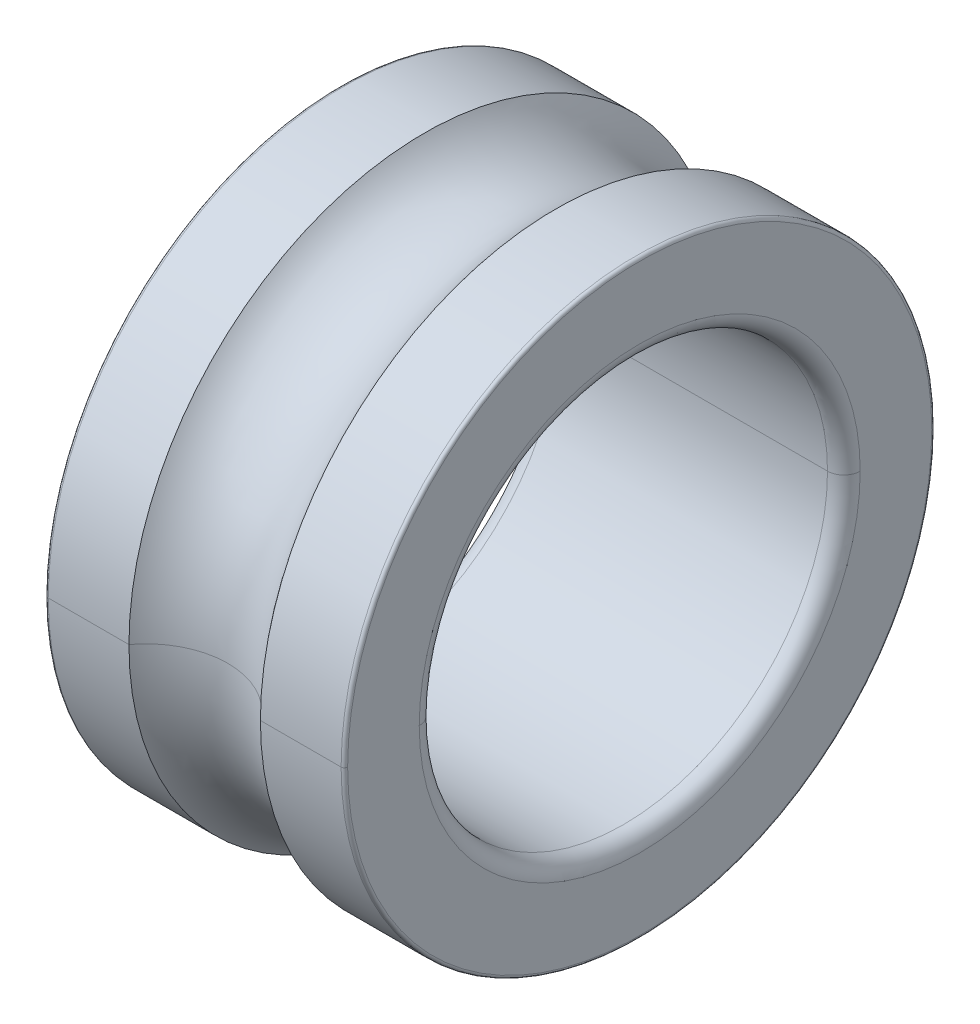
ISO-10303-21;
HEADER;
FILE_DESCRIPTION(('STEP AP214'),'2;1');
FILE_NAME('part.step','',(''),(''),'','','');
FILE_SCHEMA(('AUTOMOTIVE_DESIGN { 1 0 10303 214 1 1 1 1 }'));
ENDSEC;
DATA;
#1=APPLICATION_CONTEXT('core data for automotive mechanical design processes');
#2=APPLICATION_PROTOCOL_DEFINITION('international standard','automotive_design',2000,#1);
#3=PRODUCT_CONTEXT('',#1,'mechanical');
#4=PRODUCT('Part','Part','',(#3));
#5=PRODUCT_RELATED_PRODUCT_CATEGORY('part','',(#4));
#6=PRODUCT_DEFINITION_FORMATION('','',#4);
#7=PRODUCT_DEFINITION_CONTEXT('part definition',#1,'design');
#8=PRODUCT_DEFINITION('design','',#6,#7);
#9=PRODUCT_DEFINITION_SHAPE('','',#8);
#10=(LENGTH_UNIT() NAMED_UNIT(*) SI_UNIT(.MILLI.,.METRE.));
#11=(NAMED_UNIT(*) PLANE_ANGLE_UNIT() SI_UNIT($,.RADIAN.));
#12=(NAMED_UNIT(*) SI_UNIT($,.STERADIAN.) SOLID_ANGLE_UNIT());
#13=UNCERTAINTY_MEASURE_WITH_UNIT(LENGTH_MEASURE(1.E-05),#10,'distance_accuracy_value','');
#14=(GEOMETRIC_REPRESENTATION_CONTEXT(3) GLOBAL_UNCERTAINTY_ASSIGNED_CONTEXT((#13)) GLOBAL_UNIT_ASSIGNED_CONTEXT((#10,
#11,#12)) REPRESENTATION_CONTEXT('',''));
#15=CARTESIAN_POINT('',(0.,0.,0.));
#16=DIRECTION('',(0.,0.,1.));
#17=DIRECTION('',(1.,0.,0.));
#18=AXIS2_PLACEMENT_3D('',#15,#16,#17);
#19=CARTESIAN_POINT('',(0.120000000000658,0.,0.));
#20=DIRECTION('',(1.,0.,0.));
#21=DIRECTION('',(0.,1.,0.));
#22=AXIS2_PLACEMENT_3D('',#19,#20,#21);
#23=TOROIDAL_SURFACE('',#22,10.73,0.12);
#24=CARTESIAN_POINT('',(0.,0.,0.));
#25=DIRECTION('',(1.,0.,0.));
#26=DIRECTION('',(0.,0.,-1.));
#27=AXIS2_PLACEMENT_3D('',#24,#25,#26);
#28=CIRCLE('',#27,10.73);
#29=CARTESIAN_POINT('',(6.58001431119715E-13,0.,10.73));
#30=VERTEX_POINT('',#29);
#31=CARTESIAN_POINT('',(0.,0.,-10.73));
#32=VERTEX_POINT('',#31);
#33=EDGE_CURVE('E11',#30,#32,#28,.T.);
#34=ORIENTED_EDGE('',*,*,#33,.T.);
#35=CARTESIAN_POINT('',(6.58002298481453E-13,0.,-10.73));
#36=CARTESIAN_POINT('',(-4.16499949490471E-08,0.,-10.7319634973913));
#37=CARTESIAN_POINT('',(4.81899456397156E-05,0.,-10.7339269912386));
#38=CARTESIAN_POINT('',(0.000240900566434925,0.,-10.7378492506));
#39=CARTESIAN_POINT('',(0.000385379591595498,0.,-10.7398080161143));
#40=CARTESIAN_POINT('',(0.00077028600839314,0.,-10.7437160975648));
#41=CARTESIAN_POINT('',(0.00101071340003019,0.,-10.7456654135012));
#42=CARTESIAN_POINT('',(0.00158692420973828,0.,-10.7495499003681));
#43=CARTESIAN_POINT('',(0.00192270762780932,0.,-10.7514850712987));
#44=CARTESIAN_POINT('',(0.00268882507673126,0.,-10.7553366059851));
#45=CARTESIAN_POINT('',(0.00311915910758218,0.,-10.7572529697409));
#46=CARTESIAN_POINT('',(0.00407334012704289,0.,-10.7610622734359));
#47=CARTESIAN_POINT('',(0.00459718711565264,0.,-10.762955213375));
#48=CARTESIAN_POINT('',(0.00573713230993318,0.,-10.7667131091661));
#49=CARTESIAN_POINT('',(0.006353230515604,0.,-10.768578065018));
#50=CARTESIAN_POINT('',(0.00767619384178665,0.,-10.7722754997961));
#51=CARTESIAN_POINT('',(0.00838305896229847,0.,-10.7741079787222));
#52=CARTESIAN_POINT('',(0.00988585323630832,0.,-10.7777360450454));
#53=CARTESIAN_POINT('',(0.0106817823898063,0.,-10.7795316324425));
#54=CARTESIAN_POINT('',(0.0123607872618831,0.,-10.7830815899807));
#55=CARTESIAN_POINT('',(0.0132438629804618,0.,-10.7848359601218));
#56=CARTESIAN_POINT('',(0.0150950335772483,0.,-10.7882992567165));
#57=CARTESIAN_POINT('',(0.0160631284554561,0.,-10.7900081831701));
#58=CARTESIAN_POINT('',(0.0180820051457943,0.,-10.7933764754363));
#59=CARTESIAN_POINT('',(0.0191327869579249,0.,-10.795035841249));
#60=CARTESIAN_POINT('',(0.0213145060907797,0.,-10.7983010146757));
#61=CARTESIAN_POINT('',(0.022445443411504,0.,-10.7999068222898));
#62=CARTESIAN_POINT('',(0.0247847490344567,0.,-10.8030610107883));
#63=CARTESIAN_POINT('',(0.0259931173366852,0.,-10.8046093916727));
#64=CARTESIAN_POINT('',(0.0284843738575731,0.,-10.8076449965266));
#65=CARTESIAN_POINT('',(0.0297672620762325,0.,-10.809132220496));
#66=CARTESIAN_POINT('',(0.0324044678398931,0.,-10.8120419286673));
#67=CARTESIAN_POINT('',(0.0337587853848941,0.,-10.813464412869));
#68=CARTESIAN_POINT('',(0.0365355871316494,0.,-10.8162412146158));
#69=CARTESIAN_POINT('',(0.0379580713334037,0.,-10.8175955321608));
#70=CARTESIAN_POINT('',(0.0408677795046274,0.,-10.8202327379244));
#71=CARTESIAN_POINT('',(0.0423550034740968,0.,-10.8215156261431));
#72=CARTESIAN_POINT('',(0.0453906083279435,0.,-10.824006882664));
#73=CARTESIAN_POINT('',(0.0469389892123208,0.,-10.8252152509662));
#74=CARTESIAN_POINT('',(0.0500931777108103,0.,-10.8275545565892));
#75=CARTESIAN_POINT('',(0.0516989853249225,0.,-10.8286854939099));
#76=CARTESIAN_POINT('',(0.0549641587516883,0.,-10.8308672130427));
#77=CARTESIAN_POINT('',(0.056623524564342,0.,-10.8319179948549));
#78=CARTESIAN_POINT('',(0.0599918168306,0.,-10.8339368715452));
#79=CARTESIAN_POINT('',(0.0617007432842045,0.,-10.8349049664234));
#80=CARTESIAN_POINT('',(0.0651640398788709,0.,-10.8367561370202));
#81=CARTESIAN_POINT('',(0.0669184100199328,0.,-10.8376392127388));
#82=CARTESIAN_POINT('',(0.0704683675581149,0.,-10.8393182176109));
#83=CARTESIAN_POINT('',(0.072263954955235,0.,-10.8401141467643));
#84=CARTESIAN_POINT('',(0.0758920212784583,0.,-10.8416169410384));
#85=CARTESIAN_POINT('',(0.0777245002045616,0.,-10.8423238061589));
#86=CARTESIAN_POINT('',(0.0814219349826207,0.,-10.8436467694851));
#87=CARTESIAN_POINT('',(0.0832868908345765,0.,-10.8442628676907));
#88=CARTESIAN_POINT('',(0.0870447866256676,0.,-10.845402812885));
#89=CARTESIAN_POINT('',(0.0889377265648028,0.,-10.8459266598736));
#90=CARTESIAN_POINT('',(0.0927470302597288,0.,-10.8468808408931));
#91=CARTESIAN_POINT('',(0.0946633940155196,0.,-10.8473111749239));
#92=CARTESIAN_POINT('',(0.0985149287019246,0.,-10.8480772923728));
#93=CARTESIAN_POINT('',(0.100450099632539,0.,-10.8484130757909));
#94=CARTESIAN_POINT('',(0.104334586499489,0.,-10.8489892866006));
#95=CARTESIAN_POINT('',(0.106283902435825,0.,-10.8492297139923));
#96=CARTESIAN_POINT('',(0.110191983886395,0.,-10.8496146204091));
#97=CARTESIAN_POINT('',(0.112150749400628,0.,-10.8497590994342));
#98=CARTESIAN_POINT('',(0.116073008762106,0.,-10.849951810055));
#99=CARTESIAN_POINT('',(0.118036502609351,0.,-10.8500000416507));
#100=CARTESIAN_POINT('',(0.120000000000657,0.,-10.85));
#101=B_SPLINE_CURVE_WITH_KNOTS('',3,(#35,#36,#37,#38,#39,#40,#41,#42,#43,#44,#45,#46,#47,#48,
#49,#50,#51,#52,#53,#54,#55,#56,#57,#58,#59,#60,#61,#62,#63,#64,#65,#66,#67,#68,#69,#70,#71,#72,
#73,#74,#75,#76,#77,#78,#79,#80,#81,#82,#83,#84,#85,#86,#87,#88,#89,#90,#91,#92,#93,#94,#95,#96,
#97,#98,#99,#100),.UNSPECIFIED.,.F.,.F.,(4,2,2,2,2,2,2,2,2,2,2,2,2,2,2,2,2,2,2,2,2,2,2,2,2,2,2,
2,2,2,2,2,4),(0.,0.00588989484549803,0.0117797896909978,0.0176696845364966,0.0235595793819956,
0.0294494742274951,0.0353393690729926,0.0412292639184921,0.047119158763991,0.0530090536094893,
0.058898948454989,0.0647888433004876,0.070678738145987,0.076568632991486,0.0824585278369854,
0.0883484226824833,0.094238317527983,0.100128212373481,0.10601810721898,0.11190800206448,
0.117797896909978,0.123687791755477,0.129577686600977,0.135467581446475,0.141357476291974,
0.147247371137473,0.153137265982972,0.159027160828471,0.16491705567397,0.170806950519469,
0.176696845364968,0.182586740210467,0.188476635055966),.UNSPECIFIED.);
#102=CARTESIAN_POINT('',(0.120000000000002,0.,-10.85));
#103=VERTEX_POINT('',#102);
#104=EDGE_CURVE('E27',#32,#103,#101,.T.);
#105=ORIENTED_EDGE('',*,*,#104,.T.);
#106=CARTESIAN_POINT('',(0.120000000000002,0.,0.));
#107=DIRECTION('',(1.,0.,0.));
#108=DIRECTION('',(0.,0.,-1.));
#109=AXIS2_PLACEMENT_3D('',#106,#107,#108);
#110=CIRCLE('',#109,10.85);
#111=CARTESIAN_POINT('',(0.120000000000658,0.,10.85));
#112=VERTEX_POINT('',#111);
#113=EDGE_CURVE('E128',#112,#103,#110,.T.);
#114=ORIENTED_EDGE('',*,*,#113,.F.);
#115=CARTESIAN_POINT('',(6.58002298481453E-13,0.,10.73));
#116=CARTESIAN_POINT('',(-4.1649994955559E-08,0.,10.7319634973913));
#117=CARTESIAN_POINT('',(4.81899456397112E-05,0.,10.7339269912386));
#118=CARTESIAN_POINT('',(0.000240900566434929,0.,10.7378492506));
#119=CARTESIAN_POINT('',(0.000385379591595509,0.,10.7398080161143));
#120=CARTESIAN_POINT('',(0.000770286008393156,0.,10.7437160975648));
#121=CARTESIAN_POINT('',(0.00101071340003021,0.,10.7456654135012));
#122=CARTESIAN_POINT('',(0.00158692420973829,0.,10.7495499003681));
#123=CARTESIAN_POINT('',(0.00192270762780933,0.,10.7514850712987));
#124=CARTESIAN_POINT('',(0.00268882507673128,0.,10.7553366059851));
#125=CARTESIAN_POINT('',(0.0031191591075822,0.,10.7572529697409));
#126=CARTESIAN_POINT('',(0.00407334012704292,0.,10.7610622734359));
#127=CARTESIAN_POINT('',(0.00459718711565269,0.,10.762955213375));
#128=CARTESIAN_POINT('',(0.00573713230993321,0.,10.7667131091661));
#129=CARTESIAN_POINT('',(0.00635323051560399,0.,10.768578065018));
#130=CARTESIAN_POINT('',(0.00767619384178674,0.,10.7722754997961));
#131=CARTESIAN_POINT('',(0.00838305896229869,0.,10.7741079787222));
#132=CARTESIAN_POINT('',(0.00988585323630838,0.,10.7777360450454));
#133=CARTESIAN_POINT('',(0.0106817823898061,0.,10.7795316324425));
#134=CARTESIAN_POINT('',(0.0123607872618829,0.,10.7830815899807));
#135=CARTESIAN_POINT('',(0.013243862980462,0.,10.7848359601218));
#136=CARTESIAN_POINT('',(0.0150950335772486,0.,10.7882992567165));
#137=CARTESIAN_POINT('',(0.0160631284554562,0.,10.7900081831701));
#138=CARTESIAN_POINT('',(0.0180820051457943,0.,10.7933764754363));
#139=CARTESIAN_POINT('',(0.0191327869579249,0.,10.795035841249));
#140=CARTESIAN_POINT('',(0.0213145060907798,0.,10.7983010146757));
#141=CARTESIAN_POINT('',(0.0224454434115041,0.,10.7999068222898));
#142=CARTESIAN_POINT('',(0.0247847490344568,0.,10.8030610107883));
#143=CARTESIAN_POINT('',(0.0259931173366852,0.,10.8046093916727));
#144=CARTESIAN_POINT('',(0.0284843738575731,0.,10.8076449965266));
#145=CARTESIAN_POINT('',(0.0297672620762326,0.,10.809132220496));
#146=CARTESIAN_POINT('',(0.0324044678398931,0.,10.8120419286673));
#147=CARTESIAN_POINT('',(0.0337587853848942,0.,10.813464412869));
#148=CARTESIAN_POINT('',(0.0365355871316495,0.,10.8162412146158));
#149=CARTESIAN_POINT('',(0.0379580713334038,0.,10.8175955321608));
#150=CARTESIAN_POINT('',(0.0408677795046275,0.,10.8202327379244));
#151=CARTESIAN_POINT('',(0.0423550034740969,0.,10.8215156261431));
#152=CARTESIAN_POINT('',(0.0453906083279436,0.,10.824006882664));
#153=CARTESIAN_POINT('',(0.0469389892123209,0.,10.8252152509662));
#154=CARTESIAN_POINT('',(0.0500931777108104,0.,10.8275545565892));
#155=CARTESIAN_POINT('',(0.0516989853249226,0.,10.8286854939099));
#156=CARTESIAN_POINT('',(0.0549641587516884,0.,10.8308672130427));
#157=CARTESIAN_POINT('',(0.056623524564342,0.,10.8319179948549));
#158=CARTESIAN_POINT('',(0.0599918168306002,0.,10.8339368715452));
#159=CARTESIAN_POINT('',(0.0617007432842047,0.,10.8349049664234));
#160=CARTESIAN_POINT('',(0.065164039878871,0.,10.8367561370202));
#161=CARTESIAN_POINT('',(0.0669184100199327,0.,10.8376392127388));
#162=CARTESIAN_POINT('',(0.0704683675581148,0.,10.8393182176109));
#163=CARTESIAN_POINT('',(0.0722639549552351,0.,10.8401141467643));
#164=CARTESIAN_POINT('',(0.0758920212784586,0.,10.8416169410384));
#165=CARTESIAN_POINT('',(0.0777245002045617,0.,10.8423238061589));
#166=CARTESIAN_POINT('',(0.0814219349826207,0.,10.8436467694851));
#167=CARTESIAN_POINT('',(0.0832868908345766,0.,10.8442628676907));
#168=CARTESIAN_POINT('',(0.0870447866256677,0.,10.845402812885));
#169=CARTESIAN_POINT('',(0.0889377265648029,0.,10.8459266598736));
#170=CARTESIAN_POINT('',(0.0927470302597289,0.,10.8468808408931));
#171=CARTESIAN_POINT('',(0.0946633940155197,0.,10.8473111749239));
#172=CARTESIAN_POINT('',(0.0985149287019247,0.,10.8480772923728));
#173=CARTESIAN_POINT('',(0.100450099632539,0.,10.8484130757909));
#174=CARTESIAN_POINT('',(0.104334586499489,0.,10.8489892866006));
#175=CARTESIAN_POINT('',(0.106283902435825,0.,10.8492297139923));
#176=CARTESIAN_POINT('',(0.110191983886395,0.,10.8496146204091));
#177=CARTESIAN_POINT('',(0.112150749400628,0.,10.8497590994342));
#178=CARTESIAN_POINT('',(0.116073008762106,0.,10.849951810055));
#179=CARTESIAN_POINT('',(0.118036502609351,0.,10.8500000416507));
#180=CARTESIAN_POINT('',(0.120000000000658,0.,10.85));
#181=B_SPLINE_CURVE_WITH_KNOTS('',3,(#115,#116,#117,#118,#119,#120,#121,#122,#123,#124,#125,
#126,#127,#128,#129,#130,#131,#132,#133,#134,#135,#136,#137,#138,#139,#140,#141,#142,#143,#144,
#145,#146,#147,#148,#149,#150,#151,#152,#153,#154,#155,#156,#157,#158,#159,#160,#161,#162,#163,
#164,#165,#166,#167,#168,#169,#170,#171,#172,#173,#174,#175,#176,#177,#178,#179,#180),
.UNSPECIFIED.,.F.,.F.,(4,2,2,2,2,2,2,2,2,2,2,2,2,2,2,2,2,2,2,2,2,2,2,2,2,2,2,2,2,2,2,2,4),(0.,
0.00588989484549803,0.0117797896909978,0.0176696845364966,0.0235595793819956,0.0294494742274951,
0.0353393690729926,0.0412292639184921,0.047119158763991,0.0530090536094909,0.0588989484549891,
0.0647888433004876,0.070678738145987,0.076568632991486,0.0824585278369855,0.0883484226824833,
0.0942383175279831,0.100128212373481,0.106018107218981,0.11190800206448,0.117797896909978,
0.123687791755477,0.129577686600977,0.135467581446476,0.141357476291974,0.147247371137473,
0.153137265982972,0.159027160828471,0.16491705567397,0.170806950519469,0.176696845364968,
0.182586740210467,0.188476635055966),.UNSPECIFIED.);
#182=EDGE_CURVE('E481',#30,#112,#181,.T.);
#183=ORIENTED_EDGE('',*,*,#182,.F.);
#184=EDGE_LOOP('',(#34,#105,#114,#183));
#185=FACE_BOUND('',#184,.T.);
#186=ADVANCED_FACE('F17',(#185),#23,.T.);
#187=CARTESIAN_POINT('',(0.120000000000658,0.,0.));
#188=DIRECTION('',(1.,0.,0.));
#189=DIRECTION('',(0.,-1.,0.));
#190=AXIS2_PLACEMENT_3D('',#187,#188,#189);
#191=TOROIDAL_SURFACE('',#190,10.73,0.12);
#192=CARTESIAN_POINT('',(0.120000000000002,0.,0.));
#193=DIRECTION('',(1.,0.,0.));
#194=DIRECTION('',(0.,0.,-1.));
#195=AXIS2_PLACEMENT_3D('',#192,#193,#194);
#196=CIRCLE('',#195,10.85);
#197=EDGE_CURVE('E478',#103,#112,#196,.T.);
#198=ORIENTED_EDGE('',*,*,#197,.F.);
#199=ORIENTED_EDGE('',*,*,#104,.F.);
#200=CARTESIAN_POINT('',(0.,0.,0.));
#201=DIRECTION('',(1.,0.,0.));
#202=DIRECTION('',(0.,0.,-1.));
#203=AXIS2_PLACEMENT_3D('',#200,#201,#202);
#204=CIRCLE('',#203,10.73);
#205=EDGE_CURVE('E445',#32,#30,#204,.T.);
#206=ORIENTED_EDGE('',*,*,#205,.T.);
#207=ORIENTED_EDGE('',*,*,#182,.T.);
#208=EDGE_LOOP('',(#198,#199,#206,#207));
#209=FACE_BOUND('',#208,.T.);
#210=ADVANCED_FACE('F453',(#209),#191,.T.);
#211=CARTESIAN_POINT('',(0.,10.73,0.));
#212=DIRECTION('',(-1.,0.,0.));
#213=DIRECTION('',(0.,0.,1.));
#214=AXIS2_PLACEMENT_3D('',#211,#212,#213);
#215=PLANE('',#214);
#216=CARTESIAN_POINT('',(0.,0.,0.));
#217=DIRECTION('',(1.,0.,0.));
#218=DIRECTION('',(0.,0.,-1.));
#219=AXIS2_PLACEMENT_3D('',#216,#217,#218);
#220=CIRCLE('',#219,8.1);
#221=CARTESIAN_POINT('',(0.,0.,-8.1));
#222=VERTEX_POINT('',#221);
#223=CARTESIAN_POINT('',(0.,0.,8.1));
#224=VERTEX_POINT('',#223);
#225=EDGE_CURVE('E440',#222,#224,#220,.T.);
#226=ORIENTED_EDGE('',*,*,#225,.T.);
#227=CARTESIAN_POINT('',(0.,0.,0.));
#228=DIRECTION('',(1.,0.,0.));
#229=DIRECTION('',(0.,0.,-1.));
#230=AXIS2_PLACEMENT_3D('',#227,#228,#229);
#231=CIRCLE('',#230,8.1);
#232=EDGE_CURVE('E435',#224,#222,#231,.T.);
#233=ORIENTED_EDGE('',*,*,#232,.T.);
#234=EDGE_LOOP('',(#226,#233));
#235=FACE_BOUND('',#234,.T.);
#236=ORIENTED_EDGE('',*,*,#205,.F.);
#237=ORIENTED_EDGE('',*,*,#33,.F.);
#238=EDGE_LOOP('',(#236,#237));
#239=FACE_BOUND('',#238,.T.);
#240=ADVANCED_FACE('F461',(#235,#239),#215,.T.);
#241=CARTESIAN_POINT('',(0.600000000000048,0.,0.));
#242=DIRECTION('',(1.,0.,0.));
#243=DIRECTION('',(0.,1.,0.));
#244=AXIS2_PLACEMENT_3D('',#241,#242,#243);
#245=TOROIDAL_SURFACE('',#244,8.1,0.6);
#246=CARTESIAN_POINT('',(0.599999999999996,0.,0.));
#247=DIRECTION('',(1.,0.,0.));
#248=DIRECTION('',(0.,0.,-1.));
#249=AXIS2_PLACEMENT_3D('',#246,#247,#248);
#250=CIRCLE('',#249,7.5);
#251=CARTESIAN_POINT('',(0.599999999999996,0.,7.5));
#252=VERTEX_POINT('',#251);
#253=CARTESIAN_POINT('',(0.599999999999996,0.,-7.5));
#254=VERTEX_POINT('',#253);
#255=EDGE_CURVE('E432',#252,#254,#250,.T.);
#256=ORIENTED_EDGE('',*,*,#255,.T.);
#257=CARTESIAN_POINT('',(0.599999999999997,0.,-7.5));
#258=CARTESIAN_POINT('',(0.590182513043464,0.,-7.49999979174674));
#259=CARTESIAN_POINT('',(0.580365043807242,0.,-7.50024094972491));
#260=CARTESIAN_POINT('',(0.560753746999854,0.,-7.50120450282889));
#261=CARTESIAN_POINT('',(0.550959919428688,0.,-7.50192689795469));
#262=CARTESIAN_POINT('',(0.531419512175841,0.,-7.50385143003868));
#263=CARTESIAN_POINT('',(0.521672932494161,0.,-7.50505356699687));
#264=CARTESIAN_POINT('',(0.50225049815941,0.,-7.50793462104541));
#265=CARTESIAN_POINT('',(0.49257464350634,0.,-7.50961353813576));
#266=CARTESIAN_POINT('',(0.473316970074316,0.,-7.51344412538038));
#267=CARTESIAN_POINT('',(0.463735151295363,0.,-7.51559579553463));
#268=CARTESIAN_POINT('',(0.444688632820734,0.,-7.52036670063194));
#269=CARTESIAN_POINT('',(0.435223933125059,0.,-7.52298593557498));
#270=CARTESIAN_POINT('',(0.416434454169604,0.,-7.52868566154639));
#271=CARTESIAN_POINT('',(0.407109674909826,0.,-7.53176615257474));
#272=CARTESIAN_POINT('',(0.388622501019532,0.,-7.53838096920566));
#273=CARTESIAN_POINT('',(0.379460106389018,0.,-7.54191529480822));
#274=CARTESIAN_POINT('',(0.361319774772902,0.,-7.54942926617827));
#275=CARTESIAN_POINT('',(0.352341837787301,0.,-7.55340891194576));
#276=CARTESIAN_POINT('',(0.334592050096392,0.,-7.56180393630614));
#277=CARTESIAN_POINT('',(0.325820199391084,0.,-7.56621931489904));
#278=CARTESIAN_POINT('',(0.308503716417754,0.,-7.57547516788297));
#279=CARTESIAN_POINT('',(0.299959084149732,0.,-7.58031564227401));
#280=CARTESIAN_POINT('',(0.283117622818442,0.,-7.5904100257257));
#281=CARTESIAN_POINT('',(0.274820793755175,0.,-7.59566393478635));
#282=CARTESIAN_POINT('',(0.258494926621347,0.,-7.60657253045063));
#283=CARTESIAN_POINT('',(0.250465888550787,0.,-7.61222721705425));
#284=CARTESIAN_POINT('',(0.234694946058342,0.,-7.62392374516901));
#285=CARTESIAN_POINT('',(0.226953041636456,0.,-7.62996558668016));
#286=CARTESIAN_POINT('',(0.211775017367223,0.,-7.6424218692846));
#287=CARTESIAN_POINT('',(0.204338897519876,0.,-7.64883631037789));
#288=CARTESIAN_POINT('',(0.18979035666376,0.,-7.66202233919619));
#289=CARTESIAN_POINT('',(0.18267793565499,0.,-7.6687939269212));
#290=CARTESIAN_POINT('',(0.168793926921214,0.,-7.68267793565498));
#291=CARTESIAN_POINT('',(0.162022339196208,0.,-7.68979035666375));
#292=CARTESIAN_POINT('',(0.148836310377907,0.,-7.70433889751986));
#293=CARTESIAN_POINT('',(0.142421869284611,0.,-7.71177501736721));
#294=CARTESIAN_POINT('',(0.129965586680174,0.,-7.72695304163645));
#295=CARTESIAN_POINT('',(0.123923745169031,0.,-7.73469494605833));
#296=CARTESIAN_POINT('',(0.112227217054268,0.,-7.75046588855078));
#297=CARTESIAN_POINT('',(0.106572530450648,0.,-7.75849492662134));
#298=CARTESIAN_POINT('',(0.0956639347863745,0.,-7.77482079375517));
#299=CARTESIAN_POINT('',(0.0904100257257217,0.,-7.78311762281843));
#300=CARTESIAN_POINT('',(0.0803156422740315,0.,-7.79995908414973));
#301=CARTESIAN_POINT('',(0.0754751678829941,0.,-7.80850371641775));
#302=CARTESIAN_POINT('',(0.0662193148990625,0.,-7.82582019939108));
#303=CARTESIAN_POINT('',(0.0618039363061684,0.,-7.83459205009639));
#304=CARTESIAN_POINT('',(0.053408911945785,0.,-7.8523418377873));
#305=CARTESIAN_POINT('',(0.0494292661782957,0.,-7.8613197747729));
#306=CARTESIAN_POINT('',(0.0419152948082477,0.,-7.87946010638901));
#307=CARTESIAN_POINT('',(0.0383809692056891,0.,-7.88862250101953));
#308=CARTESIAN_POINT('',(0.031766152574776,0.,-7.90710967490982));
#309=CARTESIAN_POINT('',(0.0286856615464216,0.,-7.9164344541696));
#310=CARTESIAN_POINT('',(0.0229859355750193,0.,-7.93522393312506));
#311=CARTESIAN_POINT('',(0.0203667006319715,0.,-7.94468863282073));
#312=CARTESIAN_POINT('',(0.0155957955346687,0.,-7.96373515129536));
#313=CARTESIAN_POINT('',(0.0134441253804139,0.,-7.97331697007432));
#314=CARTESIAN_POINT('',(0.00961353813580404,0.,-7.99257464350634));
#315=CARTESIAN_POINT('',(0.00793462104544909,0.,-8.00225049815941));
#316=CARTESIAN_POINT('',(0.00505356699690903,0.,-8.02167293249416));
#317=CARTESIAN_POINT('',(0.00385143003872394,0.,-8.03141951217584));
#318=CARTESIAN_POINT('',(0.0019268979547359,0.,-8.05095991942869));
#319=CARTESIAN_POINT('',(0.00120450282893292,0.,-8.06075374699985));
#320=CARTESIAN_POINT('',(0.000240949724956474,0.,-8.08036504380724));
#321=CARTESIAN_POINT('',(-2.08253216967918E-07,0.,-8.09018251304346));
#322=CARTESIAN_POINT('',(0.,0.,-8.1));
#323=B_SPLINE_CURVE_WITH_KNOTS('',3,(#257,#258,#259,#260,#261,#262,#263,#264,#265,#266,#267,
#268,#269,#270,#271,#272,#273,#274,#275,#276,#277,#278,#279,#280,#281,#282,#283,#284,#285,#286,
#287,#288,#289,#290,#291,#292,#293,#294,#295,#296,#297,#298,#299,#300,#301,#302,#303,#304,#305,
#306,#307,#308,#309,#310,#311,#312,#313,#314,#315,#316,#317,#318,#319,#320,#321,#322),
.UNSPECIFIED.,.F.,.F.,(4,2,2,2,2,2,2,2,2,2,2,2,2,2,2,2,2,2,2,2,2,2,2,2,2,2,2,2,2,2,2,2,4),(0.,
0.029449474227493,0.0588989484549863,0.0883484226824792,0.117797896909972,0.147247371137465,
0.176696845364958,0.206146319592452,0.235595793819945,0.265045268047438,0.294494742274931,
0.323944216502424,0.353393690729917,0.38284316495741,0.412292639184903,0.441742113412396,
0.471191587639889,0.500641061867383,0.530090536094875,0.559540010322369,0.588989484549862,
0.618438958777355,0.647888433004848,0.677337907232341,0.706787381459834,0.736236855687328,
0.76568632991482,0.795135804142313,0.824585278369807,0.8540347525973,0.883484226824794,
0.912933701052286,0.942383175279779),.UNSPECIFIED.);
#324=EDGE_CURVE('E409',#254,#222,#323,.T.);
#325=ORIENTED_EDGE('',*,*,#324,.T.);
#326=ORIENTED_EDGE('',*,*,#232,.F.);
#327=CARTESIAN_POINT('',(0.599999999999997,0.,7.5));
#328=CARTESIAN_POINT('',(0.590182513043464,0.,7.49999979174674));
#329=CARTESIAN_POINT('',(0.580365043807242,0.,7.50024094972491));
#330=CARTESIAN_POINT('',(0.560753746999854,0.,7.50120450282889));
#331=CARTESIAN_POINT('',(0.550959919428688,0.,7.50192689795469));
#332=CARTESIAN_POINT('',(0.531419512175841,0.,7.50385143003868));
#333=CARTESIAN_POINT('',(0.521672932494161,0.,7.50505356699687));
#334=CARTESIAN_POINT('',(0.50225049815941,0.,7.50793462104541));
#335=CARTESIAN_POINT('',(0.49257464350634,0.,7.50961353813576));
#336=CARTESIAN_POINT('',(0.473316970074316,0.,7.51344412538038));
#337=CARTESIAN_POINT('',(0.463735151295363,0.,7.51559579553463));
#338=CARTESIAN_POINT('',(0.444688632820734,0.,7.52036670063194));
#339=CARTESIAN_POINT('',(0.435223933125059,0.,7.52298593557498));
#340=CARTESIAN_POINT('',(0.416434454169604,0.,7.52868566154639));
#341=CARTESIAN_POINT('',(0.407109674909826,0.,7.53176615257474));
#342=CARTESIAN_POINT('',(0.388622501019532,0.,7.53838096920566));
#343=CARTESIAN_POINT('',(0.379460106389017,0.,7.54191529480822));
#344=CARTESIAN_POINT('',(0.361319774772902,0.,7.54942926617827));
#345=CARTESIAN_POINT('',(0.352341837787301,0.,7.55340891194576));
#346=CARTESIAN_POINT('',(0.334592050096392,0.,7.56180393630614));
#347=CARTESIAN_POINT('',(0.325820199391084,0.,7.56621931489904));
#348=CARTESIAN_POINT('',(0.308503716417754,0.,7.57547516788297));
#349=CARTESIAN_POINT('',(0.299959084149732,0.,7.58031564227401));
#350=CARTESIAN_POINT('',(0.283117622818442,0.,7.5904100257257));
#351=CARTESIAN_POINT('',(0.274820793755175,0.,7.59566393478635));
#352=CARTESIAN_POINT('',(0.258494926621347,0.,7.60657253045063));
#353=CARTESIAN_POINT('',(0.250465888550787,0.,7.61222721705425));
#354=CARTESIAN_POINT('',(0.234694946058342,0.,7.62392374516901));
#355=CARTESIAN_POINT('',(0.226953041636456,0.,7.62996558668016));
#356=CARTESIAN_POINT('',(0.211775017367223,0.,7.6424218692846));
#357=CARTESIAN_POINT('',(0.204338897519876,0.,7.64883631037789));
#358=CARTESIAN_POINT('',(0.189790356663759,0.,7.66202233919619));
#359=CARTESIAN_POINT('',(0.18267793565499,0.,7.6687939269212));
#360=CARTESIAN_POINT('',(0.168793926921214,0.,7.68267793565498));
#361=CARTESIAN_POINT('',(0.162022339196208,0.,7.68979035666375));
#362=CARTESIAN_POINT('',(0.148836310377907,0.,7.70433889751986));
#363=CARTESIAN_POINT('',(0.142421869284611,0.,7.71177501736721));
#364=CARTESIAN_POINT('',(0.129965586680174,0.,7.72695304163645));
#365=CARTESIAN_POINT('',(0.123923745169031,0.,7.73469494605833));
#366=CARTESIAN_POINT('',(0.112227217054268,0.,7.75046588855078));
#367=CARTESIAN_POINT('',(0.106572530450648,0.,7.75849492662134));
#368=CARTESIAN_POINT('',(0.0956639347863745,0.,7.77482079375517));
#369=CARTESIAN_POINT('',(0.0904100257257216,0.,7.78311762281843));
#370=CARTESIAN_POINT('',(0.0803156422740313,0.,7.79995908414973));
#371=CARTESIAN_POINT('',(0.0754751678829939,0.,7.80850371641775));
#372=CARTESIAN_POINT('',(0.0662193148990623,0.,7.82582019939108));
#373=CARTESIAN_POINT('',(0.0618039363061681,0.,7.83459205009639));
#374=CARTESIAN_POINT('',(0.0534089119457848,0.,7.8523418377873));
#375=CARTESIAN_POINT('',(0.0494292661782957,0.,7.8613197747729));
#376=CARTESIAN_POINT('',(0.0419152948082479,0.,7.87946010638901));
#377=CARTESIAN_POINT('',(0.038380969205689,0.,7.88862250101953));
#378=CARTESIAN_POINT('',(0.0317661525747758,0.,7.90710967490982));
#379=CARTESIAN_POINT('',(0.0286856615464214,0.,7.9164344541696));
#380=CARTESIAN_POINT('',(0.0229859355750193,0.,7.93522393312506));
#381=CARTESIAN_POINT('',(0.0203667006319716,0.,7.94468863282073));
#382=CARTESIAN_POINT('',(0.0155957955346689,0.,7.96373515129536));
#383=CARTESIAN_POINT('',(0.0134441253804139,0.,7.97331697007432));
#384=CARTESIAN_POINT('',(0.00961353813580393,0.,7.99257464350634));
#385=CARTESIAN_POINT('',(0.00793462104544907,0.,8.00225049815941));
#386=CARTESIAN_POINT('',(0.00505356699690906,0.,8.02167293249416));
#387=CARTESIAN_POINT('',(0.00385143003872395,0.,8.03141951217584));
#388=CARTESIAN_POINT('',(0.00192689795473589,0.,8.05095991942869));
#389=CARTESIAN_POINT('',(0.00120450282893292,0.,8.06075374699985));
#390=CARTESIAN_POINT('',(0.000240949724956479,0.,8.08036504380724));
#391=CARTESIAN_POINT('',(-2.08253216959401E-07,0.,8.09018251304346));
#392=CARTESIAN_POINT('',(0.,0.,8.1));
#393=B_SPLINE_CURVE_WITH_KNOTS('',3,(#327,#328,#329,#330,#331,#332,#333,#334,#335,#336,#337,
#338,#339,#340,#341,#342,#343,#344,#345,#346,#347,#348,#349,#350,#351,#352,#353,#354,#355,#356,
#357,#358,#359,#360,#361,#362,#363,#364,#365,#366,#367,#368,#369,#370,#371,#372,#373,#374,#375,
#376,#377,#378,#379,#380,#381,#382,#383,#384,#385,#386,#387,#388,#389,#390,#391,#392),
.UNSPECIFIED.,.F.,.F.,(4,2,2,2,2,2,2,2,2,2,2,2,2,2,2,2,2,2,2,2,2,2,2,2,2,2,2,2,2,2,2,2,4),(0.,
0.029449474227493,0.0588989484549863,0.0883484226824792,0.117797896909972,0.147247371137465,
0.176696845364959,0.206146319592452,0.235595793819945,0.265045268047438,0.294494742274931,
0.323944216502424,0.353393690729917,0.38284316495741,0.412292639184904,0.441742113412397,
0.47119158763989,0.500641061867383,0.530090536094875,0.559540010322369,0.588989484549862,
0.618438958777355,0.647888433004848,0.677337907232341,0.706787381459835,0.736236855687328,
0.76568632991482,0.795135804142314,0.824585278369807,0.8540347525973,0.883484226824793,
0.912933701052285,0.942383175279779),.UNSPECIFIED.);
#394=EDGE_CURVE('E422',#252,#224,#393,.T.);
#395=ORIENTED_EDGE('',*,*,#394,.F.);
#396=EDGE_LOOP('',(#256,#325,#326,#395));
#397=FACE_BOUND('',#396,.T.);
#398=ADVANCED_FACE('F388',(#397),#245,.T.);
#399=CARTESIAN_POINT('',(0.600000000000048,0.,0.));
#400=DIRECTION('',(1.,0.,0.));
#401=DIRECTION('',(0.,-1.,0.));
#402=AXIS2_PLACEMENT_3D('',#399,#400,#401);
#403=TOROIDAL_SURFACE('',#402,8.1,0.6);
#404=ORIENTED_EDGE('',*,*,#225,.F.);
#405=ORIENTED_EDGE('',*,*,#324,.F.);
#406=CARTESIAN_POINT('',(0.599999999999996,0.,0.));
#407=DIRECTION('',(1.,0.,0.));
#408=DIRECTION('',(0.,0.,-1.));
#409=AXIS2_PLACEMENT_3D('',#406,#407,#408);
#410=CIRCLE('',#409,7.5);
#411=EDGE_CURVE('E368',#254,#252,#410,.T.);
#412=ORIENTED_EDGE('',*,*,#411,.T.);
#413=ORIENTED_EDGE('',*,*,#394,.T.);
#414=EDGE_LOOP('',(#404,#405,#412,#413));
#415=FACE_BOUND('',#414,.T.);
#416=ADVANCED_FACE('F377',(#415),#403,.T.);
#417=CARTESIAN_POINT('',(50.,0.,0.));
#418=DIRECTION('',(-1.,0.,0.));
#419=DIRECTION('',(0.,-1.,0.));
#420=AXIS2_PLACEMENT_3D('',#417,#418,#419);
#421=CYLINDRICAL_SURFACE('',#420,7.5);
#422=CARTESIAN_POINT('',(10.4,0.,0.));
#423=DIRECTION('',(1.,0.,0.));
#424=DIRECTION('',(0.,0.,-1.));
#425=AXIS2_PLACEMENT_3D('',#422,#423,#424);
#426=CIRCLE('',#425,7.5);
#427=CARTESIAN_POINT('',(10.4,0.,-7.5));
#428=VERTEX_POINT('',#427);
#429=CARTESIAN_POINT('',(10.4,0.,7.5));
#430=VERTEX_POINT('',#429);
#431=EDGE_CURVE('E363',#428,#430,#426,.T.);
#432=ORIENTED_EDGE('',*,*,#431,.T.);
#433=DIRECTION('',(-1.,0.,0.));
#434=VECTOR('',#433,1.);
#435=CARTESIAN_POINT('',(10.4,0.,7.5));
#436=LINE('',#435,#434);
#437=EDGE_CURVE('E357',#430,#252,#436,.T.);
#438=ORIENTED_EDGE('',*,*,#437,.T.);
#439=ORIENTED_EDGE('',*,*,#411,.F.);
#440=DIRECTION('',(-1.,0.,0.));
#441=VECTOR('',#440,1.);
#442=CARTESIAN_POINT('',(10.4,0.,-7.5));
#443=LINE('',#442,#441);
#444=EDGE_CURVE('E351',#428,#254,#443,.T.);
#445=ORIENTED_EDGE('',*,*,#444,.F.);
#446=EDGE_LOOP('',(#432,#438,#439,#445));
#447=FACE_BOUND('',#446,.T.);
#448=ADVANCED_FACE('F387',(#447),#421,.F.);
#449=CARTESIAN_POINT('',(50.,0.,0.));
#450=DIRECTION('',(-1.,0.,0.));
#451=DIRECTION('',(0.,1.,0.));
#452=AXIS2_PLACEMENT_3D('',#449,#450,#451);
#453=CYLINDRICAL_SURFACE('',#452,7.5);
#454=ORIENTED_EDGE('',*,*,#255,.F.);
#455=ORIENTED_EDGE('',*,*,#437,.F.);
#456=CARTESIAN_POINT('',(10.4,0.,0.));
#457=DIRECTION('',(1.,0.,0.));
#458=DIRECTION('',(0.,0.,-1.));
#459=AXIS2_PLACEMENT_3D('',#456,#457,#458);
#460=CIRCLE('',#459,7.5);
#461=EDGE_CURVE('E345',#430,#428,#460,.T.);
#462=ORIENTED_EDGE('',*,*,#461,.T.);
#463=ORIENTED_EDGE('',*,*,#444,.T.);
#464=EDGE_LOOP('',(#454,#455,#462,#463));
#465=FACE_BOUND('',#464,.T.);
#466=ADVANCED_FACE('F545',(#465),#453,.F.);
#467=CARTESIAN_POINT('',(10.4000000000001,0.,0.));
#468=DIRECTION('',(1.,0.,0.));
#469=DIRECTION('',(0.,1.,0.));
#470=AXIS2_PLACEMENT_3D('',#467,#468,#469);
#471=TOROIDAL_SURFACE('',#470,8.1,0.6);
#472=CARTESIAN_POINT('',(11.,0.,0.));
#473=DIRECTION('',(1.,0.,0.));
#474=DIRECTION('',(0.,0.,-1.));
#475=AXIS2_PLACEMENT_3D('',#472,#473,#474);
#476=CIRCLE('',#475,8.1);
#477=CARTESIAN_POINT('',(11.0000000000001,0.,8.1));
#478=VERTEX_POINT('',#477);
#479=CARTESIAN_POINT('',(11.,0.,-8.1));
#480=VERTEX_POINT('',#479);
#481=EDGE_CURVE('E342',#478,#480,#476,.T.);
#482=ORIENTED_EDGE('',*,*,#481,.T.);
#483=CARTESIAN_POINT('',(11.0000000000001,0.,-8.1));
#484=CARTESIAN_POINT('',(11.0000002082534,0.,-8.09018251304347));
#485=CARTESIAN_POINT('',(10.9997590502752,0.,-8.08036504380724));
#486=CARTESIAN_POINT('',(10.9987954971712,0.,-8.06075374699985));
#487=CARTESIAN_POINT('',(10.9980731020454,0.,-8.05095991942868));
#488=CARTESIAN_POINT('',(10.9961485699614,0.,-8.03141951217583));
#489=CARTESIAN_POINT('',(10.9949464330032,0.,-8.02167293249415));
#490=CARTESIAN_POINT('',(10.9920653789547,0.,-8.0022504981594));
#491=CARTESIAN_POINT('',(10.9903864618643,0.,-7.99257464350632));
#492=CARTESIAN_POINT('',(10.9865558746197,0.,-7.9733169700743));
#493=CARTESIAN_POINT('',(10.9844042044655,0.,-7.96373515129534));
#494=CARTESIAN_POINT('',(10.9796332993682,0.,-7.94468863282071));
#495=CARTESIAN_POINT('',(10.9770140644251,0.,-7.93522393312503));
#496=CARTESIAN_POINT('',(10.9713143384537,0.,-7.91643445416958));
#497=CARTESIAN_POINT('',(10.9682338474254,0.,-7.9071096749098));
#498=CARTESIAN_POINT('',(10.9616190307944,0.,-7.8886225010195));
#499=CARTESIAN_POINT('',(10.9580847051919,0.,-7.87946010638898));
#500=CARTESIAN_POINT('',(10.9505707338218,0.,-7.86131977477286));
#501=CARTESIAN_POINT('',(10.9465910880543,0.,-7.85234183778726));
#502=CARTESIAN_POINT('',(10.938196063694,0.,-7.83459205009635));
#503=CARTESIAN_POINT('',(10.9337806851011,0.,-7.82582019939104));
#504=CARTESIAN_POINT('',(10.9245248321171,0.,-7.80850371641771));
#505=CARTESIAN_POINT('',(10.9196843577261,0.,-7.79995908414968));
#506=CARTESIAN_POINT('',(10.9095899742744,0.,-7.78311762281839));
#507=CARTESIAN_POINT('',(10.9043360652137,0.,-7.77482079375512));
#508=CARTESIAN_POINT('',(10.8934274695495,0.,-7.75849492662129));
#509=CARTESIAN_POINT('',(10.8877727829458,0.,-7.75046588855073));
#510=CARTESIAN_POINT('',(10.8760762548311,0.,-7.73469494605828));
#511=CARTESIAN_POINT('',(10.8700344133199,0.,-7.7269530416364));
#512=CARTESIAN_POINT('',(10.8575781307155,0.,-7.71177501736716));
#513=CARTESIAN_POINT('',(10.8511636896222,0.,-7.70433889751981));
#514=CARTESIAN_POINT('',(10.8379776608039,0.,-7.6897903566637));
#515=CARTESIAN_POINT('',(10.8312060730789,0.,-7.68267793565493));
#516=CARTESIAN_POINT('',(10.8173220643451,0.,-7.66879392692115));
#517=CARTESIAN_POINT('',(10.8102096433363,0.,-7.66202233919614));
#518=CARTESIAN_POINT('',(10.7956611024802,0.,-7.64883631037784));
#519=CARTESIAN_POINT('',(10.7882249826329,0.,-7.64242186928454));
#520=CARTESIAN_POINT('',(10.7730469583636,0.,-7.6299655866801));
#521=CARTESIAN_POINT('',(10.7653050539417,0.,-7.62392374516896));
#522=CARTESIAN_POINT('',(10.7495341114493,0.,-7.6122272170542));
#523=CARTESIAN_POINT('',(10.7415050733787,0.,-7.60657253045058));
#524=CARTESIAN_POINT('',(10.7251792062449,0.,-7.5956639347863));
#525=CARTESIAN_POINT('',(10.7168823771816,0.,-7.59041002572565));
#526=CARTESIAN_POINT('',(10.7000409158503,0.,-7.58031564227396));
#527=CARTESIAN_POINT('',(10.6914962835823,0.,-7.57547516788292));
#528=CARTESIAN_POINT('',(10.674179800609,0.,-7.56621931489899));
#529=CARTESIAN_POINT('',(10.6654079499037,0.,-7.5618039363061));
#530=CARTESIAN_POINT('',(10.6476581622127,0.,-7.55340891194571));
#531=CARTESIAN_POINT('',(10.6386802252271,0.,-7.54942926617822));
#532=CARTESIAN_POINT('',(10.620539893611,0.,-7.54191529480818));
#533=CARTESIAN_POINT('',(10.6113774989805,0.,-7.53838096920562));
#534=CARTESIAN_POINT('',(10.5928903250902,0.,-7.53176615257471));
#535=CARTESIAN_POINT('',(10.5835655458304,0.,-7.52868566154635));
#536=CARTESIAN_POINT('',(10.564776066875,0.,-7.52298593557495));
#537=CARTESIAN_POINT('',(10.5553113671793,0.,-7.5203667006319));
#538=CARTESIAN_POINT('',(10.5362648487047,0.,-7.5155957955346));
#539=CARTESIAN_POINT('',(10.5266830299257,0.,-7.51344412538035));
#540=CARTESIAN_POINT('',(10.5074253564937,0.,-7.50961353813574));
#541=CARTESIAN_POINT('',(10.4977495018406,0.,-7.50793462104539));
#542=CARTESIAN_POINT('',(10.4783270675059,0.,-7.50505356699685));
#543=CARTESIAN_POINT('',(10.4685804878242,0.,-7.50385143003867));
#544=CARTESIAN_POINT('',(10.4490400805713,0.,-7.50192689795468));
#545=CARTESIAN_POINT('',(10.4392462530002,0.,-7.50120450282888));
#546=CARTESIAN_POINT('',(10.4196349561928,0.,-7.5002409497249));
#547=CARTESIAN_POINT('',(10.4098174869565,0.,-7.49999979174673));
#548=CARTESIAN_POINT('',(10.4,0.,-7.5));
#549=B_SPLINE_CURVE_WITH_KNOTS('',3,(#483,#484,#485,#486,#487,#488,#489,#490,#491,#492,#493,
#494,#495,#496,#497,#498,#499,#500,#501,#502,#503,#504,#505,#506,#507,#508,#509,#510,#511,#512,
#513,#514,#515,#516,#517,#518,#519,#520,#521,#522,#523,#524,#525,#526,#527,#528,#529,#530,#531,
#532,#533,#534,#535,#536,#537,#538,#539,#540,#541,#542,#543,#544,#545,#546,#547,#548),
.UNSPECIFIED.,.F.,.F.,(4,2,2,2,2,2,2,2,2,2,2,2,2,2,2,2,2,2,2,2,2,2,2,2,2,2,2,2,2,2,2,2,4),(0.,
0.0294494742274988,0.058898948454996,0.0883484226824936,0.117797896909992,0.14724737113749,
0.176696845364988,0.206146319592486,0.235595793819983,0.265045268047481,0.294494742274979,
0.323944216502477,0.353393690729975,0.382843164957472,0.41229263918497,0.441742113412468,
0.471191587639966,0.500641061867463,0.530090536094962,0.55954001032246,0.588989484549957,
0.618438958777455,0.647888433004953,0.677337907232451,0.706787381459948,0.736236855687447,
0.765686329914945,0.795135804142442,0.824585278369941,0.854034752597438,0.883484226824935,
0.912933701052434,0.942383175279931),.UNSPECIFIED.);
#550=EDGE_CURVE('E319',#480,#428,#549,.T.);
#551=ORIENTED_EDGE('',*,*,#550,.T.);
#552=ORIENTED_EDGE('',*,*,#461,.F.);
#553=CARTESIAN_POINT('',(11.0000000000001,0.,8.1));
#554=CARTESIAN_POINT('',(11.0000002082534,0.,8.09018251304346));
#555=CARTESIAN_POINT('',(10.9997590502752,0.,8.08036504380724));
#556=CARTESIAN_POINT('',(10.9987954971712,0.,8.06075374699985));
#557=CARTESIAN_POINT('',(10.9980731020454,0.,8.05095991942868));
#558=CARTESIAN_POINT('',(10.9961485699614,0.,8.03141951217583));
#559=CARTESIAN_POINT('',(10.9949464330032,0.,8.02167293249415));
#560=CARTESIAN_POINT('',(10.9920653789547,0.,8.0022504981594));
#561=CARTESIAN_POINT('',(10.9903864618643,0.,7.99257464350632));
#562=CARTESIAN_POINT('',(10.9865558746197,0.,7.9733169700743));
#563=CARTESIAN_POINT('',(10.9844042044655,0.,7.96373515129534));
#564=CARTESIAN_POINT('',(10.9796332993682,0.,7.94468863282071));
#565=CARTESIAN_POINT('',(10.9770140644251,0.,7.93522393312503));
#566=CARTESIAN_POINT('',(10.9713143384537,0.,7.91643445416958));
#567=CARTESIAN_POINT('',(10.9682338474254,0.,7.9071096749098));
#568=CARTESIAN_POINT('',(10.9616190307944,0.,7.8886225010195));
#569=CARTESIAN_POINT('',(10.9580847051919,0.,7.87946010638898));
#570=CARTESIAN_POINT('',(10.9505707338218,0.,7.86131977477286));
#571=CARTESIAN_POINT('',(10.9465910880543,0.,7.85234183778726));
#572=CARTESIAN_POINT('',(10.938196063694,0.,7.83459205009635));
#573=CARTESIAN_POINT('',(10.9337806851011,0.,7.82582019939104));
#574=CARTESIAN_POINT('',(10.9245248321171,0.,7.80850371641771));
#575=CARTESIAN_POINT('',(10.9196843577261,0.,7.79995908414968));
#576=CARTESIAN_POINT('',(10.9095899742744,0.,7.78311762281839));
#577=CARTESIAN_POINT('',(10.9043360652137,0.,7.77482079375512));
#578=CARTESIAN_POINT('',(10.8934274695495,0.,7.75849492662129));
#579=CARTESIAN_POINT('',(10.8877727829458,0.,7.75046588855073));
#580=CARTESIAN_POINT('',(10.8760762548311,0.,7.73469494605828));
#581=CARTESIAN_POINT('',(10.8700344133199,0.,7.7269530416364));
#582=CARTESIAN_POINT('',(10.8575781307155,0.,7.71177501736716));
#583=CARTESIAN_POINT('',(10.8511636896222,0.,7.70433889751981));
#584=CARTESIAN_POINT('',(10.8379776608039,0.,7.6897903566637));
#585=CARTESIAN_POINT('',(10.8312060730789,0.,7.68267793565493));
#586=CARTESIAN_POINT('',(10.8173220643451,0.,7.66879392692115));
#587=CARTESIAN_POINT('',(10.8102096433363,0.,7.66202233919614));
#588=CARTESIAN_POINT('',(10.7956611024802,0.,7.64883631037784));
#589=CARTESIAN_POINT('',(10.7882249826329,0.,7.64242186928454));
#590=CARTESIAN_POINT('',(10.7730469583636,0.,7.6299655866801));
#591=CARTESIAN_POINT('',(10.7653050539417,0.,7.62392374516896));
#592=CARTESIAN_POINT('',(10.7495341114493,0.,7.6122272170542));
#593=CARTESIAN_POINT('',(10.7415050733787,0.,7.60657253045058));
#594=CARTESIAN_POINT('',(10.7251792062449,0.,7.5956639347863));
#595=CARTESIAN_POINT('',(10.7168823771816,0.,7.59041002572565));
#596=CARTESIAN_POINT('',(10.7000409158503,0.,7.58031564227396));
#597=CARTESIAN_POINT('',(10.6914962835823,0.,7.57547516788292));
#598=CARTESIAN_POINT('',(10.674179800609,0.,7.56621931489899));
#599=CARTESIAN_POINT('',(10.6654079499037,0.,7.5618039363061));
#600=CARTESIAN_POINT('',(10.6476581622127,0.,7.55340891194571));
#601=CARTESIAN_POINT('',(10.6386802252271,0.,7.54942926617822));
#602=CARTESIAN_POINT('',(10.620539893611,0.,7.54191529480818));
#603=CARTESIAN_POINT('',(10.6113774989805,0.,7.53838096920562));
#604=CARTESIAN_POINT('',(10.5928903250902,0.,7.53176615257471));
#605=CARTESIAN_POINT('',(10.5835655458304,0.,7.52868566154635));
#606=CARTESIAN_POINT('',(10.564776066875,0.,7.52298593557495));
#607=CARTESIAN_POINT('',(10.5553113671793,0.,7.5203667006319));
#608=CARTESIAN_POINT('',(10.5362648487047,0.,7.5155957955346));
#609=CARTESIAN_POINT('',(10.5266830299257,0.,7.51344412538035));
#610=CARTESIAN_POINT('',(10.5074253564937,0.,7.50961353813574));
#611=CARTESIAN_POINT('',(10.4977495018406,0.,7.50793462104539));
#612=CARTESIAN_POINT('',(10.4783270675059,0.,7.50505356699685));
#613=CARTESIAN_POINT('',(10.4685804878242,0.,7.50385143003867));
#614=CARTESIAN_POINT('',(10.4490400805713,0.,7.50192689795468));
#615=CARTESIAN_POINT('',(10.4392462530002,0.,7.50120450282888));
#616=CARTESIAN_POINT('',(10.4196349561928,0.,7.5002409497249));
#617=CARTESIAN_POINT('',(10.4098174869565,0.,7.49999979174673));
#618=CARTESIAN_POINT('',(10.4,0.,7.5));
#619=B_SPLINE_CURVE_WITH_KNOTS('',3,(#553,#554,#555,#556,#557,#558,#559,#560,#561,#562,#563,
#564,#565,#566,#567,#568,#569,#570,#571,#572,#573,#574,#575,#576,#577,#578,#579,#580,#581,#582,
#583,#584,#585,#586,#587,#588,#589,#590,#591,#592,#593,#594,#595,#596,#597,#598,#599,#600,#601,
#602,#603,#604,#605,#606,#607,#608,#609,#610,#611,#612,#613,#614,#615,#616,#617,#618),
.UNSPECIFIED.,.F.,.F.,(4,2,2,2,2,2,2,2,2,2,2,2,2,2,2,2,2,2,2,2,2,2,2,2,2,2,2,2,2,2,2,2,4),(0.,
0.0294494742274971,0.0588989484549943,0.0883484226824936,0.11779789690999,0.147247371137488,
0.176696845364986,0.206146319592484,0.235595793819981,0.265045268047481,0.294494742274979,
0.323944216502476,0.353393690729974,0.382843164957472,0.412292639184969,0.441742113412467,
0.471191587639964,0.500641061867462,0.530090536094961,0.559540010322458,0.588989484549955,
0.618438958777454,0.647888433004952,0.677337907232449,0.706787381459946,0.736236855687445,
0.765686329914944,0.79513580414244,0.824585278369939,0.854034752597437,0.883484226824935,
0.912933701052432,0.942383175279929),.UNSPECIFIED.);
#620=EDGE_CURVE('E332',#478,#430,#619,.T.);
#621=ORIENTED_EDGE('',*,*,#620,.F.);
#622=EDGE_LOOP('',(#482,#551,#552,#621));
#623=FACE_BOUND('',#622,.T.);
#624=ADVANCED_FACE('F298',(#623),#471,.T.);
#625=CARTESIAN_POINT('',(10.4000000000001,0.,0.));
#626=DIRECTION('',(1.,0.,0.));
#627=DIRECTION('',(0.,-1.,0.));
#628=AXIS2_PLACEMENT_3D('',#625,#626,#627);
#629=TOROIDAL_SURFACE('',#628,8.1,0.6);
#630=ORIENTED_EDGE('',*,*,#431,.F.);
#631=ORIENTED_EDGE('',*,*,#550,.F.);
#632=CARTESIAN_POINT('',(11.,0.,0.));
#633=DIRECTION('',(1.,0.,0.));
#634=DIRECTION('',(0.,0.,-1.));
#635=AXIS2_PLACEMENT_3D('',#632,#633,#634);
#636=CIRCLE('',#635,8.1);
#637=EDGE_CURVE('E279',#480,#478,#636,.T.);
#638=ORIENTED_EDGE('',*,*,#637,.T.);
#639=ORIENTED_EDGE('',*,*,#620,.T.);
#640=EDGE_LOOP('',(#630,#631,#638,#639));
#641=FACE_BOUND('',#640,.T.);
#642=ADVANCED_FACE('F288',(#641),#629,.T.);
#643=CARTESIAN_POINT('',(11.,8.1,0.));
#644=DIRECTION('',(1.,0.,0.));
#645=DIRECTION('',(0.,0.,-1.));
#646=AXIS2_PLACEMENT_3D('',#643,#644,#645);
#647=PLANE('',#646);
#648=CARTESIAN_POINT('',(11.,0.,0.));
#649=DIRECTION('',(1.,0.,0.));
#650=DIRECTION('',(0.,0.,-1.));
#651=AXIS2_PLACEMENT_3D('',#648,#649,#650);
#652=CIRCLE('',#651,10.73);
#653=CARTESIAN_POINT('',(11.,0.,-10.73));
#654=VERTEX_POINT('',#653);
#655=CARTESIAN_POINT('',(10.9999999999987,0.,10.73));
#656=VERTEX_POINT('',#655);
#657=EDGE_CURVE('E274',#654,#656,#652,.T.);
#658=ORIENTED_EDGE('',*,*,#657,.T.);
#659=CARTESIAN_POINT('',(11.,0.,0.));
#660=DIRECTION('',(1.,0.,0.));
#661=DIRECTION('',(0.,0.,-1.));
#662=AXIS2_PLACEMENT_3D('',#659,#660,#661);
#663=CIRCLE('',#662,10.73);
#664=EDGE_CURVE('E269',#656,#654,#663,.T.);
#665=ORIENTED_EDGE('',*,*,#664,.T.);
#666=EDGE_LOOP('',(#658,#665));
#667=FACE_BOUND('',#666,.T.);
#668=ORIENTED_EDGE('',*,*,#637,.F.);
#669=ORIENTED_EDGE('',*,*,#481,.F.);
#670=EDGE_LOOP('',(#668,#669));
#671=FACE_BOUND('',#670,.T.);
#672=ADVANCED_FACE('F297',(#667,#671),#647,.T.);
#673=CARTESIAN_POINT('',(10.8799999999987,0.,0.));
#674=DIRECTION('',(1.,0.,0.));
#675=DIRECTION('',(0.,1.,0.));
#676=AXIS2_PLACEMENT_3D('',#673,#674,#675);
#677=TOROIDAL_SURFACE('',#676,10.73,0.12);
#678=CARTESIAN_POINT('',(10.88,0.,0.));
#679=DIRECTION('',(1.,0.,0.));
#680=DIRECTION('',(0.,0.,-1.));
#681=AXIS2_PLACEMENT_3D('',#678,#679,#680);
#682=CIRCLE('',#681,10.85);
#683=CARTESIAN_POINT('',(10.8799999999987,0.,10.85));
#684=VERTEX_POINT('',#683);
#685=CARTESIAN_POINT('',(10.88,0.,-10.85));
#686=VERTEX_POINT('',#685);
#687=EDGE_CURVE('E266',#684,#686,#682,.T.);
#688=ORIENTED_EDGE('',*,*,#687,.T.);
#689=CARTESIAN_POINT('',(10.8799999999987,0.,-10.85));
#690=CARTESIAN_POINT('',(10.88196349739,0.,-10.8500000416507));
#691=CARTESIAN_POINT('',(10.8839269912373,0.,-10.849951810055));
#692=CARTESIAN_POINT('',(10.8878492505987,0.,-10.8497590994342));
#693=CARTESIAN_POINT('',(10.889808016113,0.,-10.8496146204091));
#694=CARTESIAN_POINT('',(10.8937160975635,0.,-10.8492297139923));
#695=CARTESIAN_POINT('',(10.8956654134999,0.,-10.8489892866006));
#696=CARTESIAN_POINT('',(10.8995499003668,0.,-10.8484130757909));
#697=CARTESIAN_POINT('',(10.9014850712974,0.,-10.8480772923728));
#698=CARTESIAN_POINT('',(10.9053366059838,0.,-10.8473111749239));
#699=CARTESIAN_POINT('',(10.9072529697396,0.,-10.8468808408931));
#700=CARTESIAN_POINT('',(10.9110622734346,0.,-10.8459266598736));
#701=CARTESIAN_POINT('',(10.9129552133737,0.,-10.845402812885));
#702=CARTESIAN_POINT('',(10.9167131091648,0.,-10.8442628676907));
#703=CARTESIAN_POINT('',(10.9185780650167,0.,-10.8436467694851));
#704=CARTESIAN_POINT('',(10.9222754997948,0.,-10.8423238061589));
#705=CARTESIAN_POINT('',(10.9241079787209,0.,-10.8416169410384));
#706=CARTESIAN_POINT('',(10.9277360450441,0.,-10.8401141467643));
#707=CARTESIAN_POINT('',(10.9295316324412,0.,-10.8393182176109));
#708=CARTESIAN_POINT('',(10.9330815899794,0.,-10.8376392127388));
#709=CARTESIAN_POINT('',(10.9348359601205,0.,-10.8367561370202));
#710=CARTESIAN_POINT('',(10.9382992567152,0.,-10.8349049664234));
#711=CARTESIAN_POINT('',(10.9400081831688,0.,-10.8339368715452));
#712=CARTESIAN_POINT('',(10.943376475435,0.,-10.8319179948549));
#713=CARTESIAN_POINT('',(10.9450358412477,0.,-10.8308672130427));
#714=CARTESIAN_POINT('',(10.9483010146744,0.,-10.8286854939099));
#715=CARTESIAN_POINT('',(10.9499068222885,0.,-10.8275545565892));
#716=CARTESIAN_POINT('',(10.953061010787,0.,-10.8252152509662));
#717=CARTESIAN_POINT('',(10.9546093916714,0.,-10.824006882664));
#718=CARTESIAN_POINT('',(10.9576449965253,0.,-10.8215156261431));
#719=CARTESIAN_POINT('',(10.9591322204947,0.,-10.8202327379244));
#720=CARTESIAN_POINT('',(10.962041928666,0.,-10.8175955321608));
#721=CARTESIAN_POINT('',(10.9634644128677,0.,-10.8162412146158));
#722=CARTESIAN_POINT('',(10.9662412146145,0.,-10.813464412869));
#723=CARTESIAN_POINT('',(10.9675955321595,0.,-10.8120419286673));
#724=CARTESIAN_POINT('',(10.9702327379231,0.,-10.809132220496));
#725=CARTESIAN_POINT('',(10.9715156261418,0.,-10.8076449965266));
#726=CARTESIAN_POINT('',(10.9740068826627,0.,-10.8046093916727));
#727=CARTESIAN_POINT('',(10.9752152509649,0.,-10.8030610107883));
#728=CARTESIAN_POINT('',(10.9775545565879,0.,-10.7999068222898));
#729=CARTESIAN_POINT('',(10.9786854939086,0.,-10.7983010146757));
#730=CARTESIAN_POINT('',(10.9808672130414,0.,-10.795035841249));
#731=CARTESIAN_POINT('',(10.9819179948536,0.,-10.7933764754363));
#732=CARTESIAN_POINT('',(10.9839368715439,0.,-10.7900081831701));
#733=CARTESIAN_POINT('',(10.9849049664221,0.,-10.7882992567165));
#734=CARTESIAN_POINT('',(10.9867561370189,0.,-10.7848359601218));
#735=CARTESIAN_POINT('',(10.9876392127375,0.,-10.7830815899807));
#736=CARTESIAN_POINT('',(10.9893182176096,0.,-10.7795316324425));
#737=CARTESIAN_POINT('',(10.990114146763,0.,-10.7777360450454));
#738=CARTESIAN_POINT('',(10.9916169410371,0.,-10.7741079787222));
#739=CARTESIAN_POINT('',(10.9923238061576,0.,-10.7722754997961));
#740=CARTESIAN_POINT('',(10.9936467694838,0.,-10.768578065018));
#741=CARTESIAN_POINT('',(10.9942628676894,0.,-10.7667131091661));
#742=CARTESIAN_POINT('',(10.9954028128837,0.,-10.762955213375));
#743=CARTESIAN_POINT('',(10.9959266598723,0.,-10.7610622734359));
#744=CARTESIAN_POINT('',(10.9968808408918,0.,-10.7572529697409));
#745=CARTESIAN_POINT('',(10.9973111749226,0.,-10.7553366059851));
#746=CARTESIAN_POINT('',(10.9980772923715,0.,-10.7514850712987));
#747=CARTESIAN_POINT('',(10.9984130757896,0.,-10.7495499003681));
#748=CARTESIAN_POINT('',(10.9989892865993,0.,-10.7456654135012));
#749=CARTESIAN_POINT('',(10.999229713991,0.,-10.7437160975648));
#750=CARTESIAN_POINT('',(10.9996146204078,0.,-10.7398080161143));
#751=CARTESIAN_POINT('',(10.9997590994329,0.,-10.7378492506));
#752=CARTESIAN_POINT('',(10.9999518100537,0.,-10.7339269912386));
#753=CARTESIAN_POINT('',(11.0000000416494,0.,-10.7319634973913));
#754=CARTESIAN_POINT('',(10.9999999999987,0.,-10.73));
#755=B_SPLINE_CURVE_WITH_KNOTS('',3,(#689,#690,#691,#692,#693,#694,#695,#696,#697,#698,#699,
#700,#701,#702,#703,#704,#705,#706,#707,#708,#709,#710,#711,#712,#713,#714,#715,#716,#717,#718,
#719,#720,#721,#722,#723,#724,#725,#726,#727,#728,#729,#730,#731,#732,#733,#734,#735,#736,#737,
#738,#739,#740,#741,#742,#743,#744,#745,#746,#747,#748,#749,#750,#751,#752,#753,#754),
.UNSPECIFIED.,.F.,.F.,(4,2,2,2,2,2,2,2,2,2,2,2,2,2,2,2,2,2,2,2,2,2,2,2,2,2,2,2,2,2,2,2,4),(0.,
0.00588989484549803,0.0117797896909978,0.0176696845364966,0.0235595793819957,0.0294494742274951,
0.0353393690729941,0.0412292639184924,0.0471191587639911,0.0530090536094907,0.0588989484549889,
0.0647888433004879,0.0706787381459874,0.0765686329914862,0.0824585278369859,0.088348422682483,
0.0942383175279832,0.100128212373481,0.10601810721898,0.11190800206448,0.117797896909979,
0.123687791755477,0.129577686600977,0.135467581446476,0.141357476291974,0.147247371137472,
0.153137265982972,0.159027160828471,0.164917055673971,0.17080695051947,0.176696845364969,
0.182586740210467,0.188476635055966),.UNSPECIFIED.);
#756=EDGE_CURVE('E243',#686,#654,#755,.T.);
#757=ORIENTED_EDGE('',*,*,#756,.T.);
#758=ORIENTED_EDGE('',*,*,#664,.F.);
#759=CARTESIAN_POINT('',(10.8799999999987,0.,10.85));
#760=CARTESIAN_POINT('',(10.88196349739,0.,10.8500000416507));
#761=CARTESIAN_POINT('',(10.8839269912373,0.,10.849951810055));
#762=CARTESIAN_POINT('',(10.8878492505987,0.,10.8497590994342));
#763=CARTESIAN_POINT('',(10.889808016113,0.,10.8496146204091));
#764=CARTESIAN_POINT('',(10.8937160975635,0.,10.8492297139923));
#765=CARTESIAN_POINT('',(10.8956654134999,0.,10.8489892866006));
#766=CARTESIAN_POINT('',(10.8995499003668,0.,10.8484130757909));
#767=CARTESIAN_POINT('',(10.9014850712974,0.,10.8480772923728));
#768=CARTESIAN_POINT('',(10.9053366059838,0.,10.8473111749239));
#769=CARTESIAN_POINT('',(10.9072529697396,0.,10.8468808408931));
#770=CARTESIAN_POINT('',(10.9110622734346,0.,10.8459266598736));
#771=CARTESIAN_POINT('',(10.9129552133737,0.,10.845402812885));
#772=CARTESIAN_POINT('',(10.9167131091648,0.,10.8442628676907));
#773=CARTESIAN_POINT('',(10.9185780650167,0.,10.8436467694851));
#774=CARTESIAN_POINT('',(10.9222754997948,0.,10.8423238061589));
#775=CARTESIAN_POINT('',(10.9241079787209,0.,10.8416169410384));
#776=CARTESIAN_POINT('',(10.9277360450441,0.,10.8401141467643));
#777=CARTESIAN_POINT('',(10.9295316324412,0.,10.8393182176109));
#778=CARTESIAN_POINT('',(10.9330815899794,0.,10.8376392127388));
#779=CARTESIAN_POINT('',(10.9348359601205,0.,10.8367561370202));
#780=CARTESIAN_POINT('',(10.9382992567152,0.,10.8349049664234));
#781=CARTESIAN_POINT('',(10.9400081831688,0.,10.8339368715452));
#782=CARTESIAN_POINT('',(10.943376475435,0.,10.8319179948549));
#783=CARTESIAN_POINT('',(10.9450358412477,0.,10.8308672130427));
#784=CARTESIAN_POINT('',(10.9483010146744,0.,10.8286854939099));
#785=CARTESIAN_POINT('',(10.9499068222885,0.,10.8275545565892));
#786=CARTESIAN_POINT('',(10.953061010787,0.,10.8252152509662));
#787=CARTESIAN_POINT('',(10.9546093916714,0.,10.824006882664));
#788=CARTESIAN_POINT('',(10.9576449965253,0.,10.8215156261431));
#789=CARTESIAN_POINT('',(10.9591322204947,0.,10.8202327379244));
#790=CARTESIAN_POINT('',(10.962041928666,0.,10.8175955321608));
#791=CARTESIAN_POINT('',(10.9634644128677,0.,10.8162412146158));
#792=CARTESIAN_POINT('',(10.9662412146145,0.,10.813464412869));
#793=CARTESIAN_POINT('',(10.9675955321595,0.,10.8120419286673));
#794=CARTESIAN_POINT('',(10.9702327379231,0.,10.809132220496));
#795=CARTESIAN_POINT('',(10.9715156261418,0.,10.8076449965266));
#796=CARTESIAN_POINT('',(10.9740068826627,0.,10.8046093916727));
#797=CARTESIAN_POINT('',(10.9752152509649,0.,10.8030610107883));
#798=CARTESIAN_POINT('',(10.9775545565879,0.,10.7999068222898));
#799=CARTESIAN_POINT('',(10.9786854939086,0.,10.7983010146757));
#800=CARTESIAN_POINT('',(10.9808672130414,0.,10.795035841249));
#801=CARTESIAN_POINT('',(10.9819179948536,0.,10.7933764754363));
#802=CARTESIAN_POINT('',(10.9839368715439,0.,10.7900081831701));
#803=CARTESIAN_POINT('',(10.9849049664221,0.,10.7882992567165));
#804=CARTESIAN_POINT('',(10.9867561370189,0.,10.7848359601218));
#805=CARTESIAN_POINT('',(10.9876392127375,0.,10.7830815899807));
#806=CARTESIAN_POINT('',(10.9893182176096,0.,10.7795316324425));
#807=CARTESIAN_POINT('',(10.990114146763,0.,10.7777360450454));
#808=CARTESIAN_POINT('',(10.9916169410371,0.,10.7741079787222));
#809=CARTESIAN_POINT('',(10.9923238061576,0.,10.7722754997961));
#810=CARTESIAN_POINT('',(10.9936467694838,0.,10.768578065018));
#811=CARTESIAN_POINT('',(10.9942628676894,0.,10.7667131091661));
#812=CARTESIAN_POINT('',(10.9954028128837,0.,10.762955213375));
#813=CARTESIAN_POINT('',(10.9959266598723,0.,10.7610622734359));
#814=CARTESIAN_POINT('',(10.9968808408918,0.,10.7572529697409));
#815=CARTESIAN_POINT('',(10.9973111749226,0.,10.7553366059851));
#816=CARTESIAN_POINT('',(10.9980772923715,0.,10.7514850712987));
#817=CARTESIAN_POINT('',(10.9984130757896,0.,10.7495499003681));
#818=CARTESIAN_POINT('',(10.9989892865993,0.,10.7456654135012));
#819=CARTESIAN_POINT('',(10.999229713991,0.,10.7437160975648));
#820=CARTESIAN_POINT('',(10.9996146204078,0.,10.7398080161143));
#821=CARTESIAN_POINT('',(10.9997590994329,0.,10.7378492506));
#822=CARTESIAN_POINT('',(10.9999518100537,0.,10.7339269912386));
#823=CARTESIAN_POINT('',(11.0000000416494,0.,10.7319634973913));
#824=CARTESIAN_POINT('',(10.9999999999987,0.,10.73));
#825=B_SPLINE_CURVE_WITH_KNOTS('',3,(#759,#760,#761,#762,#763,#764,#765,#766,#767,#768,#769,
#770,#771,#772,#773,#774,#775,#776,#777,#778,#779,#780,#781,#782,#783,#784,#785,#786,#787,#788,
#789,#790,#791,#792,#793,#794,#795,#796,#797,#798,#799,#800,#801,#802,#803,#804,#805,#806,#807,
#808,#809,#810,#811,#812,#813,#814,#815,#816,#817,#818,#819,#820,#821,#822,#823,#824),
.UNSPECIFIED.,.F.,.F.,(4,2,2,2,2,2,2,2,2,2,2,2,2,2,2,2,2,2,2,2,2,2,2,2,2,2,2,2,2,2,2,2,4),(0.,
0.00588989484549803,0.0117797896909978,0.0176696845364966,0.0235595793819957,0.0294494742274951,
0.0353393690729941,0.0412292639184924,0.0471191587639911,0.0530090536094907,0.0588989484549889,
0.0647888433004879,0.0706787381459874,0.0765686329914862,0.0824585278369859,0.088348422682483,
0.0942383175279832,0.100128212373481,0.10601810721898,0.11190800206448,0.117797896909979,
0.123687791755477,0.129577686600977,0.135467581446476,0.141357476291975,0.147247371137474,
0.153137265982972,0.159027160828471,0.164917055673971,0.17080695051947,0.176696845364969,
0.182586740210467,0.188476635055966),.UNSPECIFIED.);
#826=EDGE_CURVE('E256',#684,#656,#825,.T.);
#827=ORIENTED_EDGE('',*,*,#826,.F.);
#828=EDGE_LOOP('',(#688,#757,#758,#827));
#829=FACE_BOUND('',#828,.T.);
#830=ADVANCED_FACE('F222',(#829),#677,.T.);
#831=CARTESIAN_POINT('',(10.8799999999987,0.,0.));
#832=DIRECTION('',(1.,0.,0.));
#833=DIRECTION('',(0.,-1.,0.));
#834=AXIS2_PLACEMENT_3D('',#831,#832,#833);
#835=TOROIDAL_SURFACE('',#834,10.73,0.12);
#836=ORIENTED_EDGE('',*,*,#657,.F.);
#837=ORIENTED_EDGE('',*,*,#756,.F.);
#838=CARTESIAN_POINT('',(10.88,0.,0.));
#839=DIRECTION('',(1.,0.,0.));
#840=DIRECTION('',(0.,0.,-1.));
#841=AXIS2_PLACEMENT_3D('',#838,#839,#840);
#842=CIRCLE('',#841,10.85);
#843=EDGE_CURVE('E202',#686,#684,#842,.T.);
#844=ORIENTED_EDGE('',*,*,#843,.T.);
#845=ORIENTED_EDGE('',*,*,#826,.T.);
#846=EDGE_LOOP('',(#836,#837,#844,#845));
#847=FACE_BOUND('',#846,.T.);
#848=ADVANCED_FACE('F211',(#847),#835,.T.);
#849=CARTESIAN_POINT('',(50.,0.,0.));
#850=DIRECTION('',(-1.,0.,0.));
#851=DIRECTION('',(0.,-1.,0.));
#852=AXIS2_PLACEMENT_3D('',#849,#850,#851);
#853=CYLINDRICAL_SURFACE('',#852,10.85);
#854=ORIENTED_EDGE('',*,*,#843,.F.);
#855=DIRECTION('',(-1.,0.,0.));
#856=VECTOR('',#855,1.);
#857=CARTESIAN_POINT('',(10.88,0.,-10.85));
#858=LINE('',#857,#856);
#859=CARTESIAN_POINT('',(7.9148705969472,0.,-10.85));
#860=VERTEX_POINT('',#859);
#861=EDGE_CURVE('E197',#686,#860,#858,.T.);
#862=ORIENTED_EDGE('',*,*,#861,.T.);
#863=CARTESIAN_POINT('',(7.9148705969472,0.,0.));
#864=DIRECTION('',(1.,0.,0.));
#865=DIRECTION('',(0.,0.,-1.));
#866=AXIS2_PLACEMENT_3D('',#863,#864,#865);
#867=CIRCLE('',#866,10.85);
#868=CARTESIAN_POINT('',(7.9148705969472,0.,10.85));
#869=VERTEX_POINT('',#868);
#870=EDGE_CURVE('E114',#860,#869,#867,.T.);
#871=ORIENTED_EDGE('',*,*,#870,.T.);
#872=DIRECTION('',(-1.,0.,0.));
#873=VECTOR('',#872,1.);
#874=CARTESIAN_POINT('',(10.88,0.,10.85));
#875=LINE('',#874,#873);
#876=EDGE_CURVE('E187',#684,#869,#875,.T.);
#877=ORIENTED_EDGE('',*,*,#876,.F.);
#878=EDGE_LOOP('',(#854,#862,#871,#877));
#879=FACE_BOUND('',#878,.T.);
#880=ADVANCED_FACE('F221',(#879),#853,.T.);
#881=CARTESIAN_POINT('',(50.,0.,0.));
#882=DIRECTION('',(-1.,0.,0.));
#883=DIRECTION('',(0.,1.,0.));
#884=AXIS2_PLACEMENT_3D('',#881,#882,#883);
#885=CYLINDRICAL_SURFACE('',#884,10.85);
#886=CARTESIAN_POINT('',(7.9148705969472,0.,0.));
#887=DIRECTION('',(1.,0.,0.));
#888=DIRECTION('',(0.,0.,-1.));
#889=AXIS2_PLACEMENT_3D('',#886,#887,#888);
#890=CIRCLE('',#889,10.85);
#891=EDGE_CURVE('E183',#869,#860,#890,.T.);
#892=ORIENTED_EDGE('',*,*,#891,.T.);
#893=ORIENTED_EDGE('',*,*,#861,.F.);
#894=ORIENTED_EDGE('',*,*,#687,.F.);
#895=ORIENTED_EDGE('',*,*,#876,.T.);
#896=EDGE_LOOP('',(#892,#893,#894,#895));
#897=FACE_BOUND('',#896,.T.);
#898=ADVANCED_FACE('F589',(#897),#885,.T.);
#899=CARTESIAN_POINT('',(5.5,0.,0.));
#900=DIRECTION('',(1.,0.,0.));
#901=DIRECTION('',(0.,1.,0.));
#902=AXIS2_PLACEMENT_3D('',#899,#900,#901);
#903=TOROIDAL_SURFACE('',#902,12.63,3.);
#904=ORIENTED_EDGE('',*,*,#891,.F.);
#905=CARTESIAN_POINT('',(7.91487059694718,0.,10.85));
#906=CARTESIAN_POINT('',(7.88017694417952,0.,10.8029286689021));
#907=CARTESIAN_POINT('',(7.8441038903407,0.,10.7568743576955));
#908=CARTESIAN_POINT('',(7.76932937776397,0.,10.6669513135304));
#909=CARTESIAN_POINT('',(7.73062791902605,0.,10.6230825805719));
#910=CARTESIAN_POINT('',(7.65072699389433,0.,10.5376822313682));
#911=CARTESIAN_POINT('',(7.60952752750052,0.,10.496150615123));
#912=CARTESIAN_POINT('',(7.52477193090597,0.,10.4155660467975));
#913=CARTESIAN_POINT('',(7.48121580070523,0.,10.3765130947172));
#914=CARTESIAN_POINT('',(7.39189563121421,0.,10.3010194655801));
#915=CARTESIAN_POINT('',(7.34613159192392,0.,10.2645787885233));
#916=CARTESIAN_POINT('',(7.25255207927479,0.,10.1944342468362));
#917=CARTESIAN_POINT('',(7.20473660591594,0.,10.160730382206));
#918=CARTESIAN_POINT('',(7.10721766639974,0.,10.0961746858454));
#919=CARTESIAN_POINT('',(7.05751420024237,0.,10.0653228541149));
#920=CARTESIAN_POINT('',(6.95638918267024,0.,10.0065766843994));
#921=CARTESIAN_POINT('',(6.90496763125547,0.,9.9786823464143));
#922=CARTESIAN_POINT('',(6.80058222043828,0.,9.92594651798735));
#923=CARTESIAN_POINT('',(6.74761836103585,0.,9.90110502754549));
#924=CARTESIAN_POINT('',(6.64032938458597,0.,9.85455981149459));
#925=CARTESIAN_POINT('',(6.5860042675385,0.,9.83285608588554));
#926=CARTESIAN_POINT('',(6.47617847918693,0.,9.79266059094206));
#927=CARTESIAN_POINT('',(6.42067780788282,0.,9.77416882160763));
#928=CARTESIAN_POINT('',(6.30869063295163,0.,9.74046045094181));
#929=CARTESIAN_POINT('',(6.25220412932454,0.,9.72524384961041));
#930=CARTESIAN_POINT('',(6.13843838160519,0.,9.69813783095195));
#931=CARTESIAN_POINT('',(6.08115913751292,0.,9.68624841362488));
#932=CARTESIAN_POINT('',(5.96600371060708,0.,9.66583740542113));
#933=CARTESIAN_POINT('',(5.90812752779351,0.,9.65731581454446));
#934=CARTESIAN_POINT('',(5.79197606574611,0.,9.64366958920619));
#935=CARTESIAN_POINT('',(5.73370078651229,0.,9.6385449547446));
#936=CARTESIAN_POINT('',(5.61695033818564,0.,9.63171016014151));
#937=CARTESIAN_POINT('',(5.55847516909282,0.,9.63));
#938=CARTESIAN_POINT('',(5.44152483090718,0.,9.63));
#939=CARTESIAN_POINT('',(5.38304966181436,0.,9.63171016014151));
#940=CARTESIAN_POINT('',(5.26629921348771,0.,9.6385449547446));
#941=CARTESIAN_POINT('',(5.20802393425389,0.,9.64366958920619));
#942=CARTESIAN_POINT('',(5.09187247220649,0.,9.65731581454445));
#943=CARTESIAN_POINT('',(5.03399628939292,0.,9.66583740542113));
#944=CARTESIAN_POINT('',(4.91884086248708,0.,9.68624841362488));
#945=CARTESIAN_POINT('',(4.86156161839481,0.,9.69813783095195));
#946=CARTESIAN_POINT('',(4.74779587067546,0.,9.72524384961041));
#947=CARTESIAN_POINT('',(4.69130936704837,0.,9.74046045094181));
#948=CARTESIAN_POINT('',(4.57932219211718,0.,9.77416882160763));
#949=CARTESIAN_POINT('',(4.52382152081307,0.,9.79266059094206));
#950=CARTESIAN_POINT('',(4.4139957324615,0.,9.83285608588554));
#951=CARTESIAN_POINT('',(4.35967061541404,0.,9.85455981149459));
#952=CARTESIAN_POINT('',(4.25238163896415,0.,9.90110502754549));
#953=CARTESIAN_POINT('',(4.19941777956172,0.,9.92594651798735));
#954=CARTESIAN_POINT('',(4.09503236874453,0.,9.9786823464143));
#955=CARTESIAN_POINT('',(4.04361081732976,0.,10.0065766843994));
#956=CARTESIAN_POINT('',(3.94248579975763,0.,10.0653228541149));
#957=CARTESIAN_POINT('',(3.89278233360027,0.,10.0961746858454));
#958=CARTESIAN_POINT('',(3.79526339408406,0.,10.160730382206));
#959=CARTESIAN_POINT('',(3.74744792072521,0.,10.1944342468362));
#960=CARTESIAN_POINT('',(3.65386840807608,0.,10.2645787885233));
#961=CARTESIAN_POINT('',(3.6081043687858,0.,10.3010194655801));
#962=CARTESIAN_POINT('',(3.51878419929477,0.,10.3765130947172));
#963=CARTESIAN_POINT('',(3.47522806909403,0.,10.4155660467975));
#964=CARTESIAN_POINT('',(3.39047247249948,0.,10.496150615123));
#965=CARTESIAN_POINT('',(3.34927300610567,0.,10.5376822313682));
#966=CARTESIAN_POINT('',(3.26937208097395,0.,10.6230825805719));
#967=CARTESIAN_POINT('',(3.23067062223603,0.,10.6669513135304));
#968=CARTESIAN_POINT('',(3.1558961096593,0.,10.7568743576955));
#969=CARTESIAN_POINT('',(3.11982305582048,0.,10.8029286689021));
#970=CARTESIAN_POINT('',(3.08512940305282,0.,10.85));
#971=B_SPLINE_CURVE_WITH_KNOTS('',3,(#905,#906,#907,#908,#909,#910,#911,#912,#913,#914,#915,
#916,#917,#918,#919,#920,#921,#922,#923,#924,#925,#926,#927,#928,#929,#930,#931,#932,#933,#934,
#935,#936,#937,#938,#939,#940,#941,#942,#943,#944,#945,#946,#947,#948,#949,#950,#951,#952,#953,
#954,#955,#956,#957,#958,#959,#960,#961,#962,#963,#964,#965,#966,#967,#968,#969,#970),
.UNSPECIFIED.,.F.,.F.,(4,2,2,2,2,2,2,2,2,2,2,2,2,2,2,2,2,2,2,2,2,2,2,2,2,2,2,2,2,2,2,2,4),(0.,
0.175400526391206,0.350801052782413,0.52620157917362,0.701602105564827,0.877002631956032,
1.05240315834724,1.22780368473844,1.40320421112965,1.57860473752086,1.75400526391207,
1.92940579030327,2.10480631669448,2.28020684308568,2.45560736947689,2.6310078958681,
2.8064084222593,2.98180894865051,3.15720947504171,3.33261000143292,3.50801052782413,
3.68341105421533,3.85881158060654,4.03421210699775,4.20961263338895,4.38501315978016,
4.56041368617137,4.73581421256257,4.91121473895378,5.08661526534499,5.26201579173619,
5.4374163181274,5.6128168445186),.UNSPECIFIED.);
#972=CARTESIAN_POINT('',(3.08512940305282,0.,10.85));
#973=VERTEX_POINT('',#972);
#974=EDGE_CURVE('E100',#869,#973,#971,.T.);
#975=ORIENTED_EDGE('',*,*,#974,.T.);
#976=CARTESIAN_POINT('',(3.0851294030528,0.,0.));
#977=DIRECTION('',(1.,0.,0.));
#978=DIRECTION('',(0.,0.,-1.));
#979=AXIS2_PLACEMENT_3D('',#976,#977,#978);
#980=CIRCLE('',#979,10.85);
#981=CARTESIAN_POINT('',(3.0851294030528,0.,-10.85));
#982=VERTEX_POINT('',#981);
#983=EDGE_CURVE('E92',#973,#982,#980,.T.);
#984=ORIENTED_EDGE('',*,*,#983,.T.);
#985=CARTESIAN_POINT('',(7.91487059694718,0.,-10.85));
#986=CARTESIAN_POINT('',(7.88017694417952,0.,-10.8029286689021));
#987=CARTESIAN_POINT('',(7.8441038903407,0.,-10.7568743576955));
#988=CARTESIAN_POINT('',(7.76932937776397,0.,-10.6669513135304));
#989=CARTESIAN_POINT('',(7.73062791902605,0.,-10.6230825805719));
#990=CARTESIAN_POINT('',(7.65072699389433,0.,-10.5376822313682));
#991=CARTESIAN_POINT('',(7.60952752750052,0.,-10.496150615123));
#992=CARTESIAN_POINT('',(7.52477193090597,0.,-10.4155660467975));
#993=CARTESIAN_POINT('',(7.48121580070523,0.,-10.3765130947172));
#994=CARTESIAN_POINT('',(7.39189563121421,0.,-10.3010194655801));
#995=CARTESIAN_POINT('',(7.34613159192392,0.,-10.2645787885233));
#996=CARTESIAN_POINT('',(7.25255207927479,0.,-10.1944342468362));
#997=CARTESIAN_POINT('',(7.20473660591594,0.,-10.160730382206));
#998=CARTESIAN_POINT('',(7.10721766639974,0.,-10.0961746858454));
#999=CARTESIAN_POINT('',(7.05751420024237,0.,-10.0653228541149));
#1000=CARTESIAN_POINT('',(6.95638918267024,0.,-10.0065766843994));
#1001=CARTESIAN_POINT('',(6.90496763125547,0.,-9.9786823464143));
#1002=CARTESIAN_POINT('',(6.80058222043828,0.,-9.92594651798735));
#1003=CARTESIAN_POINT('',(6.74761836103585,0.,-9.90110502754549));
#1004=CARTESIAN_POINT('',(6.64032938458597,0.,-9.85455981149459));
#1005=CARTESIAN_POINT('',(6.5860042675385,0.,-9.83285608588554));
#1006=CARTESIAN_POINT('',(6.47617847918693,0.,-9.79266059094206));
#1007=CARTESIAN_POINT('',(6.42067780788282,0.,-9.77416882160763));
#1008=CARTESIAN_POINT('',(6.30869063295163,0.,-9.74046045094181));
#1009=CARTESIAN_POINT('',(6.25220412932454,0.,-9.72524384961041));
#1010=CARTESIAN_POINT('',(6.13843838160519,0.,-9.69813783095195));
#1011=CARTESIAN_POINT('',(6.08115913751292,0.,-9.68624841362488));
#1012=CARTESIAN_POINT('',(5.96600371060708,0.,-9.66583740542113));
#1013=CARTESIAN_POINT('',(5.90812752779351,0.,-9.65731581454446));
#1014=CARTESIAN_POINT('',(5.79197606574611,0.,-9.64366958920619));
#1015=CARTESIAN_POINT('',(5.73370078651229,0.,-9.6385449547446));
#1016=CARTESIAN_POINT('',(5.61695033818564,0.,-9.63171016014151));
#1017=CARTESIAN_POINT('',(5.55847516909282,0.,-9.63));
#1018=CARTESIAN_POINT('',(5.44152483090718,0.,-9.63));
#1019=CARTESIAN_POINT('',(5.38304966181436,0.,-9.63171016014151));
#1020=CARTESIAN_POINT('',(5.26629921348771,0.,-9.6385449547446));
#1021=CARTESIAN_POINT('',(5.20802393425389,0.,-9.64366958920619));
#1022=CARTESIAN_POINT('',(5.09187247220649,0.,-9.65731581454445));
#1023=CARTESIAN_POINT('',(5.03399628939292,0.,-9.66583740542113));
#1024=CARTESIAN_POINT('',(4.91884086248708,0.,-9.68624841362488));
#1025=CARTESIAN_POINT('',(4.86156161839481,0.,-9.69813783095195));
#1026=CARTESIAN_POINT('',(4.74779587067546,0.,-9.72524384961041));
#1027=CARTESIAN_POINT('',(4.69130936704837,0.,-9.74046045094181));
#1028=CARTESIAN_POINT('',(4.57932219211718,0.,-9.77416882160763));
#1029=CARTESIAN_POINT('',(4.52382152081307,0.,-9.79266059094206));
#1030=CARTESIAN_POINT('',(4.4139957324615,0.,-9.83285608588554));
#1031=CARTESIAN_POINT('',(4.35967061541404,0.,-9.85455981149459));
#1032=CARTESIAN_POINT('',(4.25238163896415,0.,-9.90110502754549));
#1033=CARTESIAN_POINT('',(4.19941777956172,0.,-9.92594651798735));
#1034=CARTESIAN_POINT('',(4.09503236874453,0.,-9.9786823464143));
#1035=CARTESIAN_POINT('',(4.04361081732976,0.,-10.0065766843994));
#1036=CARTESIAN_POINT('',(3.94248579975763,0.,-10.0653228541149));
#1037=CARTESIAN_POINT('',(3.89278233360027,0.,-10.0961746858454));
#1038=CARTESIAN_POINT('',(3.79526339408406,0.,-10.160730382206));
#1039=CARTESIAN_POINT('',(3.74744792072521,0.,-10.1944342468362));
#1040=CARTESIAN_POINT('',(3.65386840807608,0.,-10.2645787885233));
#1041=CARTESIAN_POINT('',(3.6081043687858,0.,-10.3010194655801));
#1042=CARTESIAN_POINT('',(3.51878419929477,0.,-10.3765130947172));
#1043=CARTESIAN_POINT('',(3.47522806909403,0.,-10.4155660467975));
#1044=CARTESIAN_POINT('',(3.39047247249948,0.,-10.496150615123));
#1045=CARTESIAN_POINT('',(3.34927300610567,0.,-10.5376822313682));
#1046=CARTESIAN_POINT('',(3.26937208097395,0.,-10.6230825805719));
#1047=CARTESIAN_POINT('',(3.23067062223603,0.,-10.6669513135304));
#1048=CARTESIAN_POINT('',(3.1558961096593,0.,-10.7568743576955));
#1049=CARTESIAN_POINT('',(3.11982305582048,0.,-10.8029286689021));
#1050=CARTESIAN_POINT('',(3.08512940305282,0.,-10.85));
#1051=B_SPLINE_CURVE_WITH_KNOTS('',3,(#985,#986,#987,#988,#989,#990,#991,#992,#993,#994,#995,
#996,#997,#998,#999,#1000,#1001,#1002,#1003,#1004,#1005,#1006,#1007,#1008,#1009,#1010,#1011,
#1012,#1013,#1014,#1015,#1016,#1017,#1018,#1019,#1020,#1021,#1022,#1023,#1024,#1025,#1026,#1027,
#1028,#1029,#1030,#1031,#1032,#1033,#1034,#1035,#1036,#1037,#1038,#1039,#1040,#1041,#1042,#1043,
#1044,#1045,#1046,#1047,#1048,#1049,#1050),.UNSPECIFIED.,.F.,.F.,(4,2,2,2,2,2,2,2,2,2,2,2,2,2,2,
2,2,2,2,2,2,2,2,2,2,2,2,2,2,2,2,2,4),(0.,0.175400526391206,0.350801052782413,0.52620157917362,
0.701602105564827,0.877002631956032,1.05240315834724,1.22780368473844,1.40320421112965,
1.57860473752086,1.75400526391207,1.92940579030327,2.10480631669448,2.28020684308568,
2.45560736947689,2.6310078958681,2.8064084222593,2.98180894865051,3.15720947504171,
3.33261000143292,3.50801052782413,3.68341105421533,3.85881158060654,4.03421210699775,
4.20961263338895,4.38501315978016,4.56041368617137,4.73581421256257,4.91121473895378,
5.08661526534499,5.26201579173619,5.4374163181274,5.6128168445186),.UNSPECIFIED.);
#1052=EDGE_CURVE('E96',#860,#982,#1051,.T.);
#1053=ORIENTED_EDGE('',*,*,#1052,.F.);
#1054=EDGE_LOOP('',(#904,#975,#984,#1053));
#1055=FACE_BOUND('',#1054,.T.);
#1056=ADVANCED_FACE('F95',(#1055),#903,.F.);
#1057=CARTESIAN_POINT('',(5.5,0.,0.));
#1058=DIRECTION('',(1.,0.,0.));
#1059=DIRECTION('',(0.,-1.,0.));
#1060=AXIS2_PLACEMENT_3D('',#1057,#1058,#1059);
#1061=TOROIDAL_SURFACE('',#1060,12.63,3.);
#1062=CARTESIAN_POINT('',(3.0851294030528,0.,0.));
#1063=DIRECTION('',(1.,0.,0.));
#1064=DIRECTION('',(0.,0.,-1.));
#1065=AXIS2_PLACEMENT_3D('',#1062,#1063,#1064);
#1066=CIRCLE('',#1065,10.85);
#1067=EDGE_CURVE('E112',#982,#973,#1066,.T.);
#1068=ORIENTED_EDGE('',*,*,#1067,.T.);
#1069=ORIENTED_EDGE('',*,*,#974,.F.);
#1070=ORIENTED_EDGE('',*,*,#870,.F.);
#1071=ORIENTED_EDGE('',*,*,#1052,.T.);
#1072=EDGE_LOOP('',(#1068,#1069,#1070,#1071));
#1073=FACE_BOUND('',#1072,.T.);
#1074=ADVANCED_FACE('F111',(#1073),#1061,.F.);
#1075=CARTESIAN_POINT('',(50.,0.,0.));
#1076=DIRECTION('',(-1.,0.,0.));
#1077=DIRECTION('',(0.,-1.,0.));
#1078=AXIS2_PLACEMENT_3D('',#1075,#1076,#1077);
#1079=CYLINDRICAL_SURFACE('',#1078,10.85);
#1080=ORIENTED_EDGE('',*,*,#1067,.F.);
#1081=DIRECTION('',(-1.,0.,0.));
#1082=VECTOR('',#1081,1.);
#1083=CARTESIAN_POINT('',(3.0851294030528,0.,-10.85));
#1084=LINE('',#1083,#1082);
#1085=EDGE_CURVE('E122',#982,#103,#1084,.T.);
#1086=ORIENTED_EDGE('',*,*,#1085,.T.);
#1087=ORIENTED_EDGE('',*,*,#197,.T.);
#1088=DIRECTION('',(-1.,0.,0.));
#1089=VECTOR('',#1088,1.);
#1090=CARTESIAN_POINT('',(3.0851294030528,0.,10.85));
#1091=LINE('',#1090,#1089);
#1092=EDGE_CURVE('E124',#973,#112,#1091,.T.);
#1093=ORIENTED_EDGE('',*,*,#1092,.F.);
#1094=EDGE_LOOP('',(#1080,#1086,#1087,#1093));
#1095=FACE_BOUND('',#1094,.T.);
#1096=ADVANCED_FACE('F120',(#1095),#1079,.T.);
#1097=CARTESIAN_POINT('',(50.,0.,0.));
#1098=DIRECTION('',(-1.,0.,0.));
#1099=DIRECTION('',(0.,1.,0.));
#1100=AXIS2_PLACEMENT_3D('',#1097,#1098,#1099);
#1101=CYLINDRICAL_SURFACE('',#1100,10.85);
#1102=ORIENTED_EDGE('',*,*,#113,.T.);
#1103=ORIENTED_EDGE('',*,*,#1085,.F.);
#1104=ORIENTED_EDGE('',*,*,#983,.F.);
#1105=ORIENTED_EDGE('',*,*,#1092,.T.);
#1106=EDGE_LOOP('',(#1102,#1103,#1104,#1105));
#1107=FACE_BOUND('',#1106,.T.);
#1108=ADVANCED_FACE('F127',(#1107),#1101,.T.);
#1109=CLOSED_SHELL('',(#186,#210,#240,#398,#416,#448,#466,#624,#642,#672,#830,#848,#880,#898,
#1056,#1074,#1096,#1108));
#1110=MANIFOLD_SOLID_BREP('B1',#1109);
#1111=ADVANCED_BREP_SHAPE_REPRESENTATION('',(#18,#1110),#14);
#1112=SHAPE_DEFINITION_REPRESENTATION(#9,#1111);
ENDSEC;
END-ISO-10303-21;
